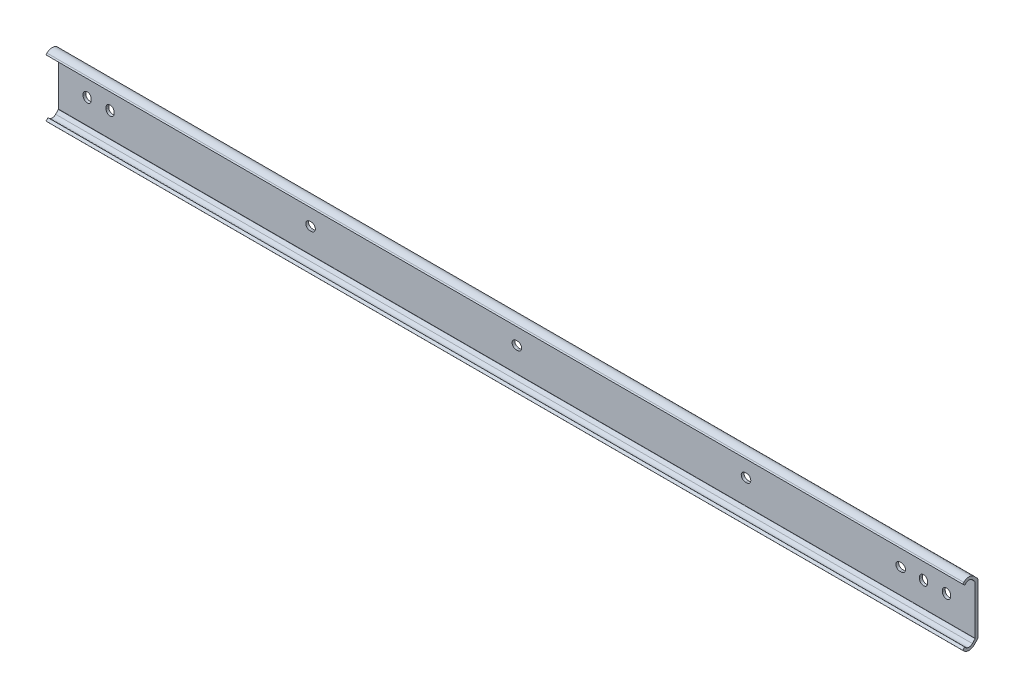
ISO-10303-21;
HEADER;
FILE_DESCRIPTION(('STEP AP214'),'2;1');
FILE_NAME('part.step','',(''),(''),'','','');
FILE_SCHEMA(('AUTOMOTIVE_DESIGN { 1 0 10303 214 1 1 1 1 }'));
ENDSEC;
DATA;
#1=APPLICATION_CONTEXT('core data for automotive mechanical design processes');
#2=APPLICATION_PROTOCOL_DEFINITION('international standard','automotive_design',2000,#1);
#3=PRODUCT_CONTEXT('',#1,'mechanical');
#4=PRODUCT('Part','Part','',(#3));
#5=PRODUCT_RELATED_PRODUCT_CATEGORY('part','',(#4));
#6=PRODUCT_DEFINITION_FORMATION('','',#4);
#7=PRODUCT_DEFINITION_CONTEXT('part definition',#1,'design');
#8=PRODUCT_DEFINITION('design','',#6,#7);
#9=PRODUCT_DEFINITION_SHAPE('','',#8);
#10=(LENGTH_UNIT() NAMED_UNIT(*) SI_UNIT(.MILLI.,.METRE.));
#11=(NAMED_UNIT(*) PLANE_ANGLE_UNIT() SI_UNIT($,.RADIAN.));
#12=(NAMED_UNIT(*) SI_UNIT($,.STERADIAN.) SOLID_ANGLE_UNIT());
#13=UNCERTAINTY_MEASURE_WITH_UNIT(LENGTH_MEASURE(1.E-05),#10,'distance_accuracy_value','');
#14=(GEOMETRIC_REPRESENTATION_CONTEXT(3) GLOBAL_UNCERTAINTY_ASSIGNED_CONTEXT((#13)) GLOBAL_UNIT_ASSIGNED_CONTEXT((#10,
#11,#12)) REPRESENTATION_CONTEXT('',''));
#15=CARTESIAN_POINT('',(0.,0.,0.));
#16=DIRECTION('',(0.,0.,1.));
#17=DIRECTION('',(1.,0.,0.));
#18=AXIS2_PLACEMENT_3D('',#15,#16,#17);
#19=CARTESIAN_POINT('',(-15.9,13.5610179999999,1.54999923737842));
#20=DIRECTION('',(0.,0.,-1.));
#21=DIRECTION('',(1.,0.,0.));
#22=AXIS2_PLACEMENT_3D('',#19,#20,#21);
#23=PLANE('',#22);
#24=DIRECTION('',(1.,0.,0.));
#25=VECTOR('',#24,1.);
#26=CARTESIAN_POINT('',(-15.9,13.5610179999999,1.54999923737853));
#27=LINE('',#26,#25);
#28=CARTESIAN_POINT('',(-15.9,13.5610179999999,1.54999923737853));
#29=VERTEX_POINT('',#28);
#30=CARTESIAN_POINT('',(492.1,13.5610179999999,1.54999923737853));
#31=VERTEX_POINT('',#30);
#32=EDGE_CURVE('E707',#29,#31,#27,.T.);
#33=ORIENTED_EDGE('',*,*,#32,.F.);
#34=DIRECTION('',(0.,1.,0.));
#35=VECTOR('',#34,1.);
#36=CARTESIAN_POINT('',(-15.9,13.5610179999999,1.54999923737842));
#37=LINE('',#36,#35);
#38=CARTESIAN_POINT('',(-15.9,-13.5610179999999,1.54999923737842));
#39=VERTEX_POINT('',#38);
#40=EDGE_CURVE('E655',#39,#29,#37,.T.);
#41=ORIENTED_EDGE('',*,*,#40,.F.);
#42=DIRECTION('',(1.,0.,0.));
#43=VECTOR('',#42,1.);
#44=CARTESIAN_POINT('',(-15.9,-13.5610179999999,1.54999923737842));
#45=LINE('',#44,#43);
#46=CARTESIAN_POINT('',(492.1,-13.5610179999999,1.54999923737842));
#47=VERTEX_POINT('',#46);
#48=EDGE_CURVE('E710',#39,#47,#45,.T.);
#49=ORIENTED_EDGE('',*,*,#48,.T.);
#50=DIRECTION('',(0.,1.,0.));
#51=VECTOR('',#50,1.);
#52=CARTESIAN_POINT('',(492.1,13.5610179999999,1.54999923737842));
#53=LINE('',#52,#51);
#54=EDGE_CURVE('E614',#47,#31,#53,.T.);
#55=ORIENTED_EDGE('',*,*,#54,.T.);
#56=EDGE_LOOP('',(#33,#41,#49,#55));
#57=FACE_BOUND('',#56,.T.);
#58=DIRECTION('',(0.,1.,0.));
#59=VECTOR('',#58,1.);
#60=CARTESIAN_POINT('',(478.45,-0.4,1.54999923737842));
#61=LINE('',#60,#59);
#62=CARTESIAN_POINT('',(478.45,-0.4,1.54999923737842));
#63=VERTEX_POINT('',#62);
#64=CARTESIAN_POINT('',(478.45,0.4,1.54999923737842));
#65=VERTEX_POINT('',#64);
#66=EDGE_CURVE('E362',#63,#65,#61,.T.);
#67=ORIENTED_EDGE('',*,*,#66,.F.);
#68=CARTESIAN_POINT('',(476.2,-0.4,1.54999923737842));
#69=DIRECTION('',(0.,0.,-1.));
#70=DIRECTION('',(1.,0.,0.));
#71=AXIS2_PLACEMENT_3D('',#68,#69,#70);
#72=CIRCLE('',#71,2.24999999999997);
#73=CARTESIAN_POINT('',(473.95,-0.4,1.54999923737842));
#74=VERTEX_POINT('',#73);
#75=EDGE_CURVE('E345',#74,#63,#72,.F.);
#76=ORIENTED_EDGE('',*,*,#75,.F.);
#77=DIRECTION('',(0.,-1.,0.));
#78=VECTOR('',#77,1.);
#79=CARTESIAN_POINT('',(473.95,-0.4,1.54999923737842));
#80=LINE('',#79,#78);
#81=CARTESIAN_POINT('',(473.95,0.4,1.54999923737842));
#82=VERTEX_POINT('',#81);
#83=EDGE_CURVE('E354',#82,#74,#80,.T.);
#84=ORIENTED_EDGE('',*,*,#83,.F.);
#85=CARTESIAN_POINT('',(476.2,0.4,1.54999923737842));
#86=DIRECTION('',(0.,0.,-1.));
#87=DIRECTION('',(1.,0.,0.));
#88=AXIS2_PLACEMENT_3D('',#85,#86,#87);
#89=CIRCLE('',#88,2.24999999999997);
#90=EDGE_CURVE('E29',#65,#82,#89,.F.);
#91=ORIENTED_EDGE('',*,*,#90,.F.);
#92=EDGE_LOOP('',(#67,#76,#84,#91));
#93=FACE_BOUND('',#92,.T.);
#94=DIRECTION('',(0.,1.,0.));
#95=VECTOR('',#94,1.);
#96=CARTESIAN_POINT('',(465.75,-0.4,1.54999923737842));
#97=LINE('',#96,#95);
#98=CARTESIAN_POINT('',(465.75,-0.4,1.54999923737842));
#99=VERTEX_POINT('',#98);
#100=CARTESIAN_POINT('',(465.75,0.4,1.54999923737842));
#101=VERTEX_POINT('',#100);
#102=EDGE_CURVE('E380',#99,#101,#97,.T.);
#103=ORIENTED_EDGE('',*,*,#102,.F.);
#104=CARTESIAN_POINT('',(463.5,-0.4,1.54999923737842));
#105=DIRECTION('',(0.,0.,-1.));
#106=DIRECTION('',(1.,0.,0.));
#107=AXIS2_PLACEMENT_3D('',#104,#105,#106);
#108=CIRCLE('',#107,2.24999999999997);
#109=CARTESIAN_POINT('',(461.25,-0.4,1.54999923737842));
#110=VERTEX_POINT('',#109);
#111=EDGE_CURVE('E383',#110,#99,#108,.F.);
#112=ORIENTED_EDGE('',*,*,#111,.F.);
#113=DIRECTION('',(0.,-1.,0.));
#114=VECTOR('',#113,1.);
#115=CARTESIAN_POINT('',(461.25,-0.4,1.54999923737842));
#116=LINE('',#115,#114);
#117=CARTESIAN_POINT('',(461.25,0.4,1.54999923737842));
#118=VERTEX_POINT('',#117);
#119=EDGE_CURVE('E400',#118,#110,#116,.T.);
#120=ORIENTED_EDGE('',*,*,#119,.F.);
#121=CARTESIAN_POINT('',(463.5,0.4,1.54999923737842));
#122=DIRECTION('',(0.,0.,-1.));
#123=DIRECTION('',(1.,0.,0.));
#124=AXIS2_PLACEMENT_3D('',#121,#122,#123);
#125=CIRCLE('',#124,2.24999999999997);
#126=EDGE_CURVE('E357',#101,#118,#125,.F.);
#127=ORIENTED_EDGE('',*,*,#126,.F.);
#128=EDGE_LOOP('',(#103,#112,#120,#127));
#129=FACE_BOUND('',#128,.T.);
#130=DIRECTION('',(1.,0.,0.));
#131=VECTOR('',#130,1.);
#132=CARTESIAN_POINT('',(450.4,-2.24999999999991,1.54999923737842));
#133=LINE('',#132,#131);
#134=CARTESIAN_POINT('',(450.4,-2.24999999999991,1.54999923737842));
#135=VERTEX_POINT('',#134);
#136=CARTESIAN_POINT('',(451.2,-2.24999999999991,1.54999923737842));
#137=VERTEX_POINT('',#136);
#138=EDGE_CURVE('E411',#135,#137,#133,.T.);
#139=ORIENTED_EDGE('',*,*,#138,.F.);
#140=CARTESIAN_POINT('',(450.4,0.,1.54999923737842));
#141=DIRECTION('',(0.,0.,-1.));
#142=DIRECTION('',(1.,0.,0.));
#143=AXIS2_PLACEMENT_3D('',#140,#141,#142);
#144=CIRCLE('',#143,2.24999999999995);
#145=CARTESIAN_POINT('',(450.4,2.25,1.54999923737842));
#146=VERTEX_POINT('',#145);
#147=EDGE_CURVE('E414',#146,#135,#144,.F.);
#148=ORIENTED_EDGE('',*,*,#147,.F.);
#149=DIRECTION('',(-1.,0.,0.));
#150=VECTOR('',#149,1.);
#151=CARTESIAN_POINT('',(450.4,2.25,1.54999923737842));
#152=LINE('',#151,#150);
#153=CARTESIAN_POINT('',(451.2,2.25,1.54999923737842));
#154=VERTEX_POINT('',#153);
#155=EDGE_CURVE('E431',#154,#146,#152,.T.);
#156=ORIENTED_EDGE('',*,*,#155,.F.);
#157=CARTESIAN_POINT('',(451.2,0.,1.54999923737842));
#158=DIRECTION('',(0.,0.,-1.));
#159=DIRECTION('',(1.,0.,0.));
#160=AXIS2_PLACEMENT_3D('',#157,#158,#159);
#161=CIRCLE('',#160,2.24999999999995);
#162=EDGE_CURVE('E409',#137,#154,#161,.F.);
#163=ORIENTED_EDGE('',*,*,#162,.F.);
#164=EDGE_LOOP('',(#139,#148,#156,#163));
#165=FACE_BOUND('',#164,.T.);
#166=DIRECTION('',(1.,0.,0.));
#167=VECTOR('',#166,1.);
#168=CARTESIAN_POINT('',(364.7,-2.24999999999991,1.54999923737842));
#169=LINE('',#168,#167);
#170=CARTESIAN_POINT('',(364.7,-2.24999999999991,1.54999923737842));
#171=VERTEX_POINT('',#170);
#172=CARTESIAN_POINT('',(365.5,-2.24999999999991,1.54999923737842));
#173=VERTEX_POINT('',#172);
#174=EDGE_CURVE('E442',#171,#173,#169,.T.);
#175=ORIENTED_EDGE('',*,*,#174,.F.);
#176=CARTESIAN_POINT('',(364.7,0.,1.54999923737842));
#177=DIRECTION('',(0.,0.,-1.));
#178=DIRECTION('',(1.,0.,0.));
#179=AXIS2_PLACEMENT_3D('',#176,#177,#178);
#180=CIRCLE('',#179,2.24999999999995);
#181=CARTESIAN_POINT('',(364.7,2.25,1.54999923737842));
#182=VERTEX_POINT('',#181);
#183=EDGE_CURVE('E445',#182,#171,#180,.F.);
#184=ORIENTED_EDGE('',*,*,#183,.F.);
#185=DIRECTION('',(-1.,0.,0.));
#186=VECTOR('',#185,1.);
#187=CARTESIAN_POINT('',(364.7,2.25,1.54999923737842));
#188=LINE('',#187,#186);
#189=CARTESIAN_POINT('',(365.5,2.25,1.54999923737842));
#190=VERTEX_POINT('',#189);
#191=EDGE_CURVE('E462',#190,#182,#188,.T.);
#192=ORIENTED_EDGE('',*,*,#191,.F.);
#193=CARTESIAN_POINT('',(365.5,0.,1.54999923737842));
#194=DIRECTION('',(0.,0.,-1.));
#195=DIRECTION('',(1.,0.,0.));
#196=AXIS2_PLACEMENT_3D('',#193,#194,#195);
#197=CIRCLE('',#196,2.24999999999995);
#198=EDGE_CURVE('E440',#173,#190,#197,.F.);
#199=ORIENTED_EDGE('',*,*,#198,.F.);
#200=EDGE_LOOP('',(#175,#184,#192,#199));
#201=FACE_BOUND('',#200,.T.);
#202=DIRECTION('',(1.,0.,0.));
#203=VECTOR('',#202,1.);
#204=CARTESIAN_POINT('',(237.7,-2.24999999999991,1.54999923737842));
#205=LINE('',#204,#203);
#206=CARTESIAN_POINT('',(237.7,-2.24999999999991,1.54999923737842));
#207=VERTEX_POINT('',#206);
#208=CARTESIAN_POINT('',(238.5,-2.24999999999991,1.54999923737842));
#209=VERTEX_POINT('',#208);
#210=EDGE_CURVE('E473',#207,#209,#205,.T.);
#211=ORIENTED_EDGE('',*,*,#210,.F.);
#212=CARTESIAN_POINT('',(237.7,0.,1.54999923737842));
#213=DIRECTION('',(0.,0.,-1.));
#214=DIRECTION('',(1.,0.,0.));
#215=AXIS2_PLACEMENT_3D('',#212,#213,#214);
#216=CIRCLE('',#215,2.24999999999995);
#217=CARTESIAN_POINT('',(237.7,2.25,1.54999923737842));
#218=VERTEX_POINT('',#217);
#219=EDGE_CURVE('E476',#218,#207,#216,.F.);
#220=ORIENTED_EDGE('',*,*,#219,.F.);
#221=DIRECTION('',(-1.,0.,0.));
#222=VECTOR('',#221,1.);
#223=CARTESIAN_POINT('',(237.7,2.25,1.54999923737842));
#224=LINE('',#223,#222);
#225=CARTESIAN_POINT('',(238.5,2.25,1.54999923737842));
#226=VERTEX_POINT('',#225);
#227=EDGE_CURVE('E493',#226,#218,#224,.T.);
#228=ORIENTED_EDGE('',*,*,#227,.F.);
#229=CARTESIAN_POINT('',(238.5,0.,1.54999923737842));
#230=DIRECTION('',(0.,0.,-1.));
#231=DIRECTION('',(1.,0.,0.));
#232=AXIS2_PLACEMENT_3D('',#229,#230,#231);
#233=CIRCLE('',#232,2.24999999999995);
#234=EDGE_CURVE('E471',#209,#226,#233,.F.);
#235=ORIENTED_EDGE('',*,*,#234,.F.);
#236=EDGE_LOOP('',(#211,#220,#228,#235));
#237=FACE_BOUND('',#236,.T.);
#238=DIRECTION('',(0.,1.,0.));
#239=VECTOR('',#238,1.);
#240=CARTESIAN_POINT('',(14.95,-0.4,1.54999923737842));
#241=LINE('',#240,#239);
#242=CARTESIAN_POINT('',(14.95,-0.4,1.54999923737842));
#243=VERTEX_POINT('',#242);
#244=CARTESIAN_POINT('',(14.95,0.4,1.54999923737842));
#245=VERTEX_POINT('',#244);
#246=EDGE_CURVE('E504',#243,#245,#241,.T.);
#247=ORIENTED_EDGE('',*,*,#246,.F.);
#248=CARTESIAN_POINT('',(12.7,-0.4,1.54999923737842));
#249=DIRECTION('',(0.,0.,-1.));
#250=DIRECTION('',(1.,0.,0.));
#251=AXIS2_PLACEMENT_3D('',#248,#249,#250);
#252=CIRCLE('',#251,2.24999999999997);
#253=CARTESIAN_POINT('',(10.45,-0.4,1.54999923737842));
#254=VERTEX_POINT('',#253);
#255=EDGE_CURVE('E507',#254,#243,#252,.F.);
#256=ORIENTED_EDGE('',*,*,#255,.F.);
#257=DIRECTION('',(0.,-1.,0.));
#258=VECTOR('',#257,1.);
#259=CARTESIAN_POINT('',(10.45,-0.4,1.54999923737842));
#260=LINE('',#259,#258);
#261=CARTESIAN_POINT('',(10.45,0.4,1.54999923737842));
#262=VERTEX_POINT('',#261);
#263=EDGE_CURVE('E524',#262,#254,#260,.T.);
#264=ORIENTED_EDGE('',*,*,#263,.F.);
#265=CARTESIAN_POINT('',(12.7,0.4,1.54999923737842));
#266=DIRECTION('',(0.,0.,-1.));
#267=DIRECTION('',(1.,0.,0.));
#268=AXIS2_PLACEMENT_3D('',#265,#266,#267);
#269=CIRCLE('',#268,2.24999999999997);
#270=EDGE_CURVE('E502',#245,#262,#269,.F.);
#271=ORIENTED_EDGE('',*,*,#270,.F.);
#272=EDGE_LOOP('',(#247,#256,#264,#271));
#273=FACE_BOUND('',#272,.T.);
#274=DIRECTION('',(0.,1.,0.));
#275=VECTOR('',#274,1.);
#276=CARTESIAN_POINT('',(2.24999999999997,-0.4,1.54999923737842));
#277=LINE('',#276,#275);
#278=CARTESIAN_POINT('',(2.24999999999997,-0.4,1.54999923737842));
#279=VERTEX_POINT('',#278);
#280=CARTESIAN_POINT('',(2.24999999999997,0.4,1.54999923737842));
#281=VERTEX_POINT('',#280);
#282=EDGE_CURVE('E535',#279,#281,#277,.T.);
#283=ORIENTED_EDGE('',*,*,#282,.F.);
#284=CARTESIAN_POINT('',(0.,-0.4,1.54999923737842));
#285=DIRECTION('',(0.,0.,-1.));
#286=DIRECTION('',(1.,0.,0.));
#287=AXIS2_PLACEMENT_3D('',#284,#285,#286);
#288=CIRCLE('',#287,2.24999999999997);
#289=CARTESIAN_POINT('',(-2.25000000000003,-0.4,1.54999923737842));
#290=VERTEX_POINT('',#289);
#291=EDGE_CURVE('E538',#290,#279,#288,.F.);
#292=ORIENTED_EDGE('',*,*,#291,.F.);
#293=DIRECTION('',(0.,-1.,0.));
#294=VECTOR('',#293,1.);
#295=CARTESIAN_POINT('',(-2.25000000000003,-0.4,1.54999923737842));
#296=LINE('',#295,#294);
#297=CARTESIAN_POINT('',(-2.25000000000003,0.4,1.54999923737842));
#298=VERTEX_POINT('',#297);
#299=EDGE_CURVE('E555',#298,#290,#296,.T.);
#300=ORIENTED_EDGE('',*,*,#299,.F.);
#301=CARTESIAN_POINT('',(0.,0.4,1.54999923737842));
#302=DIRECTION('',(0.,0.,-1.));
#303=DIRECTION('',(1.,0.,0.));
#304=AXIS2_PLACEMENT_3D('',#301,#302,#303);
#305=CIRCLE('',#304,2.24999999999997);
#306=EDGE_CURVE('E533',#281,#298,#305,.F.);
#307=ORIENTED_EDGE('',*,*,#306,.F.);
#308=EDGE_LOOP('',(#283,#292,#300,#307));
#309=FACE_BOUND('',#308,.T.);
#310=DIRECTION('',(1.,0.,0.));
#311=VECTOR('',#310,1.);
#312=CARTESIAN_POINT('',(123.4,-2.24999999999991,1.54999923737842));
#313=LINE('',#312,#311);
#314=CARTESIAN_POINT('',(123.4,-2.24999999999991,1.54999923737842));
#315=VERTEX_POINT('',#314);
#316=CARTESIAN_POINT('',(124.2,-2.24999999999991,1.54999923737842));
#317=VERTEX_POINT('',#316);
#318=EDGE_CURVE('E566',#315,#317,#313,.T.);
#319=ORIENTED_EDGE('',*,*,#318,.F.);
#320=CARTESIAN_POINT('',(123.4,0.,1.54999923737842));
#321=DIRECTION('',(0.,0.,-1.));
#322=DIRECTION('',(1.,0.,0.));
#323=AXIS2_PLACEMENT_3D('',#320,#321,#322);
#324=CIRCLE('',#323,2.24999999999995);
#325=CARTESIAN_POINT('',(123.4,2.25,1.54999923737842));
#326=VERTEX_POINT('',#325);
#327=EDGE_CURVE('E569',#326,#315,#324,.F.);
#328=ORIENTED_EDGE('',*,*,#327,.F.);
#329=DIRECTION('',(-1.,0.,0.));
#330=VECTOR('',#329,1.);
#331=CARTESIAN_POINT('',(123.4,2.25,1.54999923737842));
#332=LINE('',#331,#330);
#333=CARTESIAN_POINT('',(124.2,2.25,1.54999923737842));
#334=VERTEX_POINT('',#333);
#335=EDGE_CURVE('E586',#334,#326,#332,.T.);
#336=ORIENTED_EDGE('',*,*,#335,.F.);
#337=CARTESIAN_POINT('',(124.2,0.,1.54999923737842));
#338=DIRECTION('',(0.,0.,-1.));
#339=DIRECTION('',(1.,0.,0.));
#340=AXIS2_PLACEMENT_3D('',#337,#338,#339);
#341=CIRCLE('',#340,2.24999999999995);
#342=EDGE_CURVE('E564',#317,#334,#341,.F.);
#343=ORIENTED_EDGE('',*,*,#342,.F.);
#344=EDGE_LOOP('',(#319,#328,#336,#343));
#345=FACE_BOUND('',#344,.T.);
#346=ADVANCED_FACE('F14',(#57,#93,#129,#165,#201,#237,#273,#309,#345),#23,.F.);
#347=CARTESIAN_POINT('',(-15.9,13.5610176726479,0.));
#348=DIRECTION('',(0.,0.,1.));
#349=DIRECTION('',(-1.,0.,0.));
#350=AXIS2_PLACEMENT_3D('',#347,#348,#349);
#351=PLANE('',#350);
#352=DIRECTION('',(0.,1.,0.));
#353=VECTOR('',#352,1.);
#354=CARTESIAN_POINT('',(473.95,-0.4,0.));
#355=LINE('',#354,#353);
#356=CARTESIAN_POINT('',(473.95,-0.4,0.));
#357=VERTEX_POINT('',#356);
#358=CARTESIAN_POINT('',(473.95,0.4,0.));
#359=VERTEX_POINT('',#358);
#360=EDGE_CURVE('E364',#357,#359,#355,.T.);
#361=ORIENTED_EDGE('',*,*,#360,.F.);
#362=CARTESIAN_POINT('',(476.2,-0.4,0.));
#363=DIRECTION('',(0.,0.,-1.));
#364=DIRECTION('',(1.,0.,0.));
#365=AXIS2_PLACEMENT_3D('',#362,#363,#364);
#366=CIRCLE('',#365,2.24999999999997);
#367=CARTESIAN_POINT('',(478.45,-0.4,0.));
#368=VERTEX_POINT('',#367);
#369=EDGE_CURVE('E37',#368,#357,#366,.T.);
#370=ORIENTED_EDGE('',*,*,#369,.F.);
#371=DIRECTION('',(0.,-1.,0.));
#372=VECTOR('',#371,1.);
#373=CARTESIAN_POINT('',(478.45,-0.4,0.));
#374=LINE('',#373,#372);
#375=CARTESIAN_POINT('',(478.45,0.4,0.));
#376=VERTEX_POINT('',#375);
#377=EDGE_CURVE('E351',#376,#368,#374,.T.);
#378=ORIENTED_EDGE('',*,*,#377,.F.);
#379=CARTESIAN_POINT('',(476.2,0.4,0.));
#380=DIRECTION('',(0.,0.,-1.));
#381=DIRECTION('',(1.,0.,0.));
#382=AXIS2_PLACEMENT_3D('',#379,#380,#381);
#383=CIRCLE('',#382,2.24999999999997);
#384=EDGE_CURVE('E370',#359,#376,#383,.T.);
#385=ORIENTED_EDGE('',*,*,#384,.F.);
#386=EDGE_LOOP('',(#361,#370,#378,#385));
#387=FACE_BOUND('',#386,.T.);
#388=DIRECTION('',(0.,1.,0.));
#389=VECTOR('',#388,1.);
#390=CARTESIAN_POINT('',(461.25,-0.4,0.));
#391=LINE('',#390,#389);
#392=CARTESIAN_POINT('',(461.25,-0.4,0.));
#393=VERTEX_POINT('',#392);
#394=CARTESIAN_POINT('',(461.25,0.4,0.));
#395=VERTEX_POINT('',#394);
#396=EDGE_CURVE('E388',#393,#395,#391,.T.);
#397=ORIENTED_EDGE('',*,*,#396,.F.);
#398=CARTESIAN_POINT('',(463.5,-0.4,0.));
#399=DIRECTION('',(0.,0.,-1.));
#400=DIRECTION('',(1.,0.,0.));
#401=AXIS2_PLACEMENT_3D('',#398,#399,#400);
#402=CIRCLE('',#401,2.24999999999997);
#403=CARTESIAN_POINT('',(465.75,-0.4,0.));
#404=VERTEX_POINT('',#403);
#405=EDGE_CURVE('E386',#404,#393,#402,.T.);
#406=ORIENTED_EDGE('',*,*,#405,.F.);
#407=DIRECTION('',(0.,-1.,0.));
#408=VECTOR('',#407,1.);
#409=CARTESIAN_POINT('',(465.75,-0.4,0.));
#410=LINE('',#409,#408);
#411=CARTESIAN_POINT('',(465.75,0.4,0.));
#412=VERTEX_POINT('',#411);
#413=EDGE_CURVE('E394',#412,#404,#410,.T.);
#414=ORIENTED_EDGE('',*,*,#413,.F.);
#415=CARTESIAN_POINT('',(463.5,0.4,0.));
#416=DIRECTION('',(0.,0.,-1.));
#417=DIRECTION('',(1.,0.,0.));
#418=AXIS2_PLACEMENT_3D('',#415,#416,#417);
#419=CIRCLE('',#418,2.24999999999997);
#420=EDGE_CURVE('E391',#395,#412,#419,.T.);
#421=ORIENTED_EDGE('',*,*,#420,.F.);
#422=EDGE_LOOP('',(#397,#406,#414,#421));
#423=FACE_BOUND('',#422,.T.);
#424=DIRECTION('',(1.,0.,0.));
#425=VECTOR('',#424,1.);
#426=CARTESIAN_POINT('',(450.4,2.25,0.));
#427=LINE('',#426,#425);
#428=CARTESIAN_POINT('',(450.4,2.25,0.));
#429=VERTEX_POINT('',#428);
#430=CARTESIAN_POINT('',(451.2,2.25,0.));
#431=VERTEX_POINT('',#430);
#432=EDGE_CURVE('E419',#429,#431,#427,.T.);
#433=ORIENTED_EDGE('',*,*,#432,.F.);
#434=CARTESIAN_POINT('',(450.4,0.,0.));
#435=DIRECTION('',(0.,0.,-1.));
#436=DIRECTION('',(1.,0.,0.));
#437=AXIS2_PLACEMENT_3D('',#434,#435,#436);
#438=CIRCLE('',#437,2.24999999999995);
#439=CARTESIAN_POINT('',(450.4,-2.24999999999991,0.));
#440=VERTEX_POINT('',#439);
#441=EDGE_CURVE('E417',#440,#429,#438,.T.);
#442=ORIENTED_EDGE('',*,*,#441,.F.);
#443=DIRECTION('',(-1.,0.,0.));
#444=VECTOR('',#443,1.);
#445=CARTESIAN_POINT('',(450.4,-2.24999999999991,0.));
#446=LINE('',#445,#444);
#447=CARTESIAN_POINT('',(451.2,-2.24999999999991,0.));
#448=VERTEX_POINT('',#447);
#449=EDGE_CURVE('E425',#448,#440,#446,.T.);
#450=ORIENTED_EDGE('',*,*,#449,.F.);
#451=CARTESIAN_POINT('',(451.2,0.,0.));
#452=DIRECTION('',(0.,0.,-1.));
#453=DIRECTION('',(1.,0.,0.));
#454=AXIS2_PLACEMENT_3D('',#451,#452,#453);
#455=CIRCLE('',#454,2.24999999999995);
#456=EDGE_CURVE('E422',#431,#448,#455,.T.);
#457=ORIENTED_EDGE('',*,*,#456,.F.);
#458=EDGE_LOOP('',(#433,#442,#450,#457));
#459=FACE_BOUND('',#458,.T.);
#460=DIRECTION('',(1.,0.,0.));
#461=VECTOR('',#460,1.);
#462=CARTESIAN_POINT('',(364.7,2.25,0.));
#463=LINE('',#462,#461);
#464=CARTESIAN_POINT('',(364.7,2.25,0.));
#465=VERTEX_POINT('',#464);
#466=CARTESIAN_POINT('',(365.5,2.25,0.));
#467=VERTEX_POINT('',#466);
#468=EDGE_CURVE('E450',#465,#467,#463,.T.);
#469=ORIENTED_EDGE('',*,*,#468,.F.);
#470=CARTESIAN_POINT('',(364.7,0.,0.));
#471=DIRECTION('',(0.,0.,-1.));
#472=DIRECTION('',(1.,0.,0.));
#473=AXIS2_PLACEMENT_3D('',#470,#471,#472);
#474=CIRCLE('',#473,2.24999999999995);
#475=CARTESIAN_POINT('',(364.7,-2.24999999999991,0.));
#476=VERTEX_POINT('',#475);
#477=EDGE_CURVE('E448',#476,#465,#474,.T.);
#478=ORIENTED_EDGE('',*,*,#477,.F.);
#479=DIRECTION('',(-1.,0.,0.));
#480=VECTOR('',#479,1.);
#481=CARTESIAN_POINT('',(364.7,-2.24999999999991,0.));
#482=LINE('',#481,#480);
#483=CARTESIAN_POINT('',(365.5,-2.24999999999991,0.));
#484=VERTEX_POINT('',#483);
#485=EDGE_CURVE('E456',#484,#476,#482,.T.);
#486=ORIENTED_EDGE('',*,*,#485,.F.);
#487=CARTESIAN_POINT('',(365.5,0.,0.));
#488=DIRECTION('',(0.,0.,-1.));
#489=DIRECTION('',(1.,0.,0.));
#490=AXIS2_PLACEMENT_3D('',#487,#488,#489);
#491=CIRCLE('',#490,2.24999999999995);
#492=EDGE_CURVE('E453',#467,#484,#491,.T.);
#493=ORIENTED_EDGE('',*,*,#492,.F.);
#494=EDGE_LOOP('',(#469,#478,#486,#493));
#495=FACE_BOUND('',#494,.T.);
#496=DIRECTION('',(1.,0.,0.));
#497=VECTOR('',#496,1.);
#498=CARTESIAN_POINT('',(237.7,2.25,0.));
#499=LINE('',#498,#497);
#500=CARTESIAN_POINT('',(237.7,2.25,0.));
#501=VERTEX_POINT('',#500);
#502=CARTESIAN_POINT('',(238.5,2.25,0.));
#503=VERTEX_POINT('',#502);
#504=EDGE_CURVE('E481',#501,#503,#499,.T.);
#505=ORIENTED_EDGE('',*,*,#504,.F.);
#506=CARTESIAN_POINT('',(237.7,0.,0.));
#507=DIRECTION('',(0.,0.,-1.));
#508=DIRECTION('',(1.,0.,0.));
#509=AXIS2_PLACEMENT_3D('',#506,#507,#508);
#510=CIRCLE('',#509,2.24999999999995);
#511=CARTESIAN_POINT('',(237.7,-2.24999999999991,0.));
#512=VERTEX_POINT('',#511);
#513=EDGE_CURVE('E479',#512,#501,#510,.T.);
#514=ORIENTED_EDGE('',*,*,#513,.F.);
#515=DIRECTION('',(-1.,0.,0.));
#516=VECTOR('',#515,1.);
#517=CARTESIAN_POINT('',(237.7,-2.24999999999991,0.));
#518=LINE('',#517,#516);
#519=CARTESIAN_POINT('',(238.5,-2.24999999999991,0.));
#520=VERTEX_POINT('',#519);
#521=EDGE_CURVE('E487',#520,#512,#518,.T.);
#522=ORIENTED_EDGE('',*,*,#521,.F.);
#523=CARTESIAN_POINT('',(238.5,0.,0.));
#524=DIRECTION('',(0.,0.,-1.));
#525=DIRECTION('',(1.,0.,0.));
#526=AXIS2_PLACEMENT_3D('',#523,#524,#525);
#527=CIRCLE('',#526,2.24999999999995);
#528=EDGE_CURVE('E484',#503,#520,#527,.T.);
#529=ORIENTED_EDGE('',*,*,#528,.F.);
#530=EDGE_LOOP('',(#505,#514,#522,#529));
#531=FACE_BOUND('',#530,.T.);
#532=DIRECTION('',(0.,1.,0.));
#533=VECTOR('',#532,1.);
#534=CARTESIAN_POINT('',(10.45,-0.4,0.));
#535=LINE('',#534,#533);
#536=CARTESIAN_POINT('',(10.45,-0.4,0.));
#537=VERTEX_POINT('',#536);
#538=CARTESIAN_POINT('',(10.45,0.4,0.));
#539=VERTEX_POINT('',#538);
#540=EDGE_CURVE('E512',#537,#539,#535,.T.);
#541=ORIENTED_EDGE('',*,*,#540,.F.);
#542=CARTESIAN_POINT('',(12.7,-0.4,0.));
#543=DIRECTION('',(0.,0.,-1.));
#544=DIRECTION('',(1.,0.,0.));
#545=AXIS2_PLACEMENT_3D('',#542,#543,#544);
#546=CIRCLE('',#545,2.24999999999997);
#547=CARTESIAN_POINT('',(14.95,-0.4,0.));
#548=VERTEX_POINT('',#547);
#549=EDGE_CURVE('E510',#548,#537,#546,.T.);
#550=ORIENTED_EDGE('',*,*,#549,.F.);
#551=DIRECTION('',(0.,-1.,0.));
#552=VECTOR('',#551,1.);
#553=CARTESIAN_POINT('',(14.95,-0.4,0.));
#554=LINE('',#553,#552);
#555=CARTESIAN_POINT('',(14.95,0.4,0.));
#556=VERTEX_POINT('',#555);
#557=EDGE_CURVE('E518',#556,#548,#554,.T.);
#558=ORIENTED_EDGE('',*,*,#557,.F.);
#559=CARTESIAN_POINT('',(12.7,0.4,0.));
#560=DIRECTION('',(0.,0.,-1.));
#561=DIRECTION('',(1.,0.,0.));
#562=AXIS2_PLACEMENT_3D('',#559,#560,#561);
#563=CIRCLE('',#562,2.24999999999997);
#564=EDGE_CURVE('E515',#539,#556,#563,.T.);
#565=ORIENTED_EDGE('',*,*,#564,.F.);
#566=EDGE_LOOP('',(#541,#550,#558,#565));
#567=FACE_BOUND('',#566,.T.);
#568=DIRECTION('',(0.,1.,0.));
#569=VECTOR('',#568,1.);
#570=CARTESIAN_POINT('',(-2.25000000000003,-0.4,0.));
#571=LINE('',#570,#569);
#572=CARTESIAN_POINT('',(-2.25000000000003,-0.4,0.));
#573=VERTEX_POINT('',#572);
#574=CARTESIAN_POINT('',(-2.25000000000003,0.4,0.));
#575=VERTEX_POINT('',#574);
#576=EDGE_CURVE('E543',#573,#575,#571,.T.);
#577=ORIENTED_EDGE('',*,*,#576,.F.);
#578=CARTESIAN_POINT('',(0.,-0.4,0.));
#579=DIRECTION('',(0.,0.,-1.));
#580=DIRECTION('',(1.,0.,0.));
#581=AXIS2_PLACEMENT_3D('',#578,#579,#580);
#582=CIRCLE('',#581,2.24999999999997);
#583=CARTESIAN_POINT('',(2.24999999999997,-0.4,0.));
#584=VERTEX_POINT('',#583);
#585=EDGE_CURVE('E541',#584,#573,#582,.T.);
#586=ORIENTED_EDGE('',*,*,#585,.F.);
#587=DIRECTION('',(0.,-1.,0.));
#588=VECTOR('',#587,1.);
#589=CARTESIAN_POINT('',(2.24999999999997,-0.4,0.));
#590=LINE('',#589,#588);
#591=CARTESIAN_POINT('',(2.24999999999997,0.4,0.));
#592=VERTEX_POINT('',#591);
#593=EDGE_CURVE('E549',#592,#584,#590,.T.);
#594=ORIENTED_EDGE('',*,*,#593,.F.);
#595=CARTESIAN_POINT('',(0.,0.4,0.));
#596=DIRECTION('',(0.,0.,-1.));
#597=DIRECTION('',(1.,0.,0.));
#598=AXIS2_PLACEMENT_3D('',#595,#596,#597);
#599=CIRCLE('',#598,2.24999999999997);
#600=EDGE_CURVE('E546',#575,#592,#599,.T.);
#601=ORIENTED_EDGE('',*,*,#600,.F.);
#602=EDGE_LOOP('',(#577,#586,#594,#601));
#603=FACE_BOUND('',#602,.T.);
#604=DIRECTION('',(1.,0.,0.));
#605=VECTOR('',#604,1.);
#606=CARTESIAN_POINT('',(123.4,2.25,0.));
#607=LINE('',#606,#605);
#608=CARTESIAN_POINT('',(123.4,2.25,0.));
#609=VERTEX_POINT('',#608);
#610=CARTESIAN_POINT('',(124.2,2.25,0.));
#611=VERTEX_POINT('',#610);
#612=EDGE_CURVE('E574',#609,#611,#607,.T.);
#613=ORIENTED_EDGE('',*,*,#612,.F.);
#614=CARTESIAN_POINT('',(123.4,0.,0.));
#615=DIRECTION('',(0.,0.,-1.));
#616=DIRECTION('',(1.,0.,0.));
#617=AXIS2_PLACEMENT_3D('',#614,#615,#616);
#618=CIRCLE('',#617,2.24999999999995);
#619=CARTESIAN_POINT('',(123.4,-2.24999999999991,0.));
#620=VERTEX_POINT('',#619);
#621=EDGE_CURVE('E572',#620,#609,#618,.T.);
#622=ORIENTED_EDGE('',*,*,#621,.F.);
#623=DIRECTION('',(-1.,0.,0.));
#624=VECTOR('',#623,1.);
#625=CARTESIAN_POINT('',(123.4,-2.24999999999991,0.));
#626=LINE('',#625,#624);
#627=CARTESIAN_POINT('',(124.2,-2.24999999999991,0.));
#628=VERTEX_POINT('',#627);
#629=EDGE_CURVE('E580',#628,#620,#626,.T.);
#630=ORIENTED_EDGE('',*,*,#629,.F.);
#631=CARTESIAN_POINT('',(124.2,0.,0.));
#632=DIRECTION('',(0.,0.,-1.));
#633=DIRECTION('',(1.,0.,0.));
#634=AXIS2_PLACEMENT_3D('',#631,#632,#633);
#635=CIRCLE('',#634,2.24999999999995);
#636=EDGE_CURVE('E577',#611,#628,#635,.T.);
#637=ORIENTED_EDGE('',*,*,#636,.F.);
#638=EDGE_LOOP('',(#613,#622,#630,#637));
#639=FACE_BOUND('',#638,.T.);
#640=DIRECTION('',(1.,0.,0.));
#641=VECTOR('',#640,1.);
#642=CARTESIAN_POINT('',(-15.9,-13.5610176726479,0.));
#643=LINE('',#642,#641);
#644=CARTESIAN_POINT('',(-15.9,-13.5610176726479,0.));
#645=VERTEX_POINT('',#644);
#646=CARTESIAN_POINT('',(492.1,-13.5610176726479,0.));
#647=VERTEX_POINT('',#646);
#648=EDGE_CURVE('E677',#645,#647,#643,.T.);
#649=ORIENTED_EDGE('',*,*,#648,.F.);
#650=DIRECTION('',(0.,-1.,0.));
#651=VECTOR('',#650,1.);
#652=CARTESIAN_POINT('',(-15.9,13.5610176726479,0.));
#653=LINE('',#652,#651);
#654=CARTESIAN_POINT('',(-15.9,13.5610176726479,0.));
#655=VERTEX_POINT('',#654);
#656=EDGE_CURVE('E675',#655,#645,#653,.T.);
#657=ORIENTED_EDGE('',*,*,#656,.F.);
#658=DIRECTION('',(1.,0.,0.));
#659=VECTOR('',#658,1.);
#660=CARTESIAN_POINT('',(-15.9,13.5610176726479,0.));
#661=LINE('',#660,#659);
#662=CARTESIAN_POINT('',(492.1,13.5610176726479,0.));
#663=VERTEX_POINT('',#662);
#664=EDGE_CURVE('E680',#655,#663,#661,.T.);
#665=ORIENTED_EDGE('',*,*,#664,.T.);
#666=DIRECTION('',(0.,-1.,0.));
#667=VECTOR('',#666,1.);
#668=CARTESIAN_POINT('',(492.1,13.5610176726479,0.));
#669=LINE('',#668,#667);
#670=EDGE_CURVE('E634',#663,#647,#669,.T.);
#671=ORIENTED_EDGE('',*,*,#670,.T.);
#672=EDGE_LOOP('',(#649,#657,#665,#671));
#673=FACE_BOUND('',#672,.T.);
#674=ADVANCED_FACE('F765',(#387,#423,#459,#495,#531,#567,#603,#639,#673),#351,.F.);
#675=CARTESIAN_POINT('',(-15.9,-13.5610175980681,1.80000204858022));
#676=DIRECTION('',(1.,0.,0.));
#677=DIRECTION('',(0.,0.,1.));
#678=AXIS2_PLACEMENT_3D('',#675,#676,#677);
#679=PLANE('',#678);
#680=ORIENTED_EDGE('',*,*,#40,.T.);
#681=CARTESIAN_POINT('',(-15.9,13.5610175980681,1.80000204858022));
#682=DIRECTION('',(1.,0.,0.));
#683=DIRECTION('',(0.,0.,1.));
#684=AXIS2_PLACEMENT_3D('',#681,#682,#683);
#685=CIRCLE('',#684,0.250002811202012);
#686=CARTESIAN_POINT('',(-15.9,13.7341215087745,1.61962344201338));
#687=VERTEX_POINT('',#686);
#688=EDGE_CURVE('E657',#29,#687,#685,.T.);
#689=ORIENTED_EDGE('',*,*,#688,.T.);
#690=DIRECTION('',(0.,0.72150413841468,0.692410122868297));
#691=VECTOR('',#690,1.);
#692=CARTESIAN_POINT('',(-15.9,13.7341215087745,1.61962344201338));
#693=LINE('',#692,#691);
#694=CARTESIAN_POINT('',(-15.9,15.2920521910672,3.11473194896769));
#695=VERTEX_POINT('',#694);
#696=EDGE_CURVE('E659',#687,#695,#693,.T.);
#697=ORIENTED_EDGE('',*,*,#696,.T.);
#698=CARTESIAN_POINT('',(-15.9,13.5750002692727,4.99999970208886));
#699=DIRECTION('',(1.,0.,0.));
#700=DIRECTION('',(0.,0.,1.));
#701=AXIS2_PLACEMENT_3D('',#698,#699,#700);
#702=CIRCLE('',#701,2.55000035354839);
#703=CARTESIAN_POINT('',(-15.9,15.2920597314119,6.88526058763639));
#704=VERTEX_POINT('',#703);
#705=EDGE_CURVE('E661',#695,#704,#702,.T.);
#706=ORIENTED_EDGE('',*,*,#705,.T.);
#707=DIRECTION('',(0.,-0.721504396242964,0.692409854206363));
#708=VECTOR('',#707,1.);
#709=CARTESIAN_POINT('',(-15.9,15.2920597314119,6.88526058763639));
#710=LINE('',#709,#708);
#711=CARTESIAN_POINT('',(-15.9,14.7934625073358,7.36375196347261));
#712=VERTEX_POINT('',#711);
#713=EDGE_CURVE('E663',#704,#712,#710,.T.);
#714=ORIENTED_EDGE('',*,*,#713,.T.);
#715=DIRECTION('',(0.,0.707106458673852,0.707107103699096));
#716=VECTOR('',#715,1.);
#717=CARTESIAN_POINT('',(-15.9,14.7934625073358,7.36375196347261));
#718=LINE('',#717,#716);
#719=CARTESIAN_POINT('',(-15.9,15.8897095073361,8.45999996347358));
#720=VERTEX_POINT('',#719);
#721=EDGE_CURVE('E665',#712,#720,#718,.T.);
#722=ORIENTED_EDGE('',*,*,#721,.T.);
#723=DIRECTION('',(0.,0.721503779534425,-0.692410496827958));
#724=VECTOR('',#723,1.);
#725=CARTESIAN_POINT('',(-15.9,16.4741385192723,7.89913695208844));
#726=LINE('',#725,#724);
#727=CARTESIAN_POINT('',(-15.9,16.4741385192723,7.89913695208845));
#728=VERTEX_POINT('',#727);
#729=EDGE_CURVE('E667',#720,#728,#726,.T.);
#730=ORIENTED_EDGE('',*,*,#729,.T.);
#731=CARTESIAN_POINT('',(-15.9,13.5750002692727,4.99999970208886));
#732=DIRECTION('',(-1.,0.,0.));
#733=DIRECTION('',(0.,0.,-1.));
#734=AXIS2_PLACEMENT_3D('',#731,#732,#733);
#735=CIRCLE('',#734,4.09999992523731);
#736=CARTESIAN_POINT('',(-15.9,16.4741380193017,2.10086195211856));
#737=VERTEX_POINT('',#736);
#738=EDGE_CURVE('E669',#728,#737,#735,.T.);
#739=ORIENTED_EDGE('',*,*,#738,.T.);
#740=DIRECTION('',(0.,-0.721504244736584,-0.692410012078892));
#741=VECTOR('',#740,1.);
#742=CARTESIAN_POINT('',(-15.9,14.8073560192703,0.501291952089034));
#743=LINE('',#742,#741);
#744=CARTESIAN_POINT('',(-15.9,14.8073560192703,0.501291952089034));
#745=VERTEX_POINT('',#744);
#746=EDGE_CURVE('E671',#737,#745,#743,.T.);
#747=ORIENTED_EDGE('',*,*,#746,.T.);
#748=CARTESIAN_POINT('',(-15.9,13.5610175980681,1.80000204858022));
#749=DIRECTION('',(-1.,0.,0.));
#750=DIRECTION('',(0.,0.,-1.));
#751=AXIS2_PLACEMENT_3D('',#748,#749,#750);
#752=CIRCLE('',#751,1.80000204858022);
#753=EDGE_CURVE('E673',#745,#655,#752,.T.);
#754=ORIENTED_EDGE('',*,*,#753,.T.);
#755=ORIENTED_EDGE('',*,*,#656,.T.);
#756=CARTESIAN_POINT('',(-15.9,-13.5610175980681,1.80000204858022));
#757=DIRECTION('',(-1.,0.,0.));
#758=DIRECTION('',(0.,0.,1.));
#759=AXIS2_PLACEMENT_3D('',#756,#757,#758);
#760=CIRCLE('',#759,1.80000204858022);
#761=CARTESIAN_POINT('',(-15.9,-14.8073560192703,0.501291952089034));
#762=VERTEX_POINT('',#761);
#763=EDGE_CURVE('E636',#645,#762,#760,.T.);
#764=ORIENTED_EDGE('',*,*,#763,.T.);
#765=DIRECTION('',(0.,-0.721504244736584,0.692410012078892));
#766=VECTOR('',#765,1.);
#767=CARTESIAN_POINT('',(-15.9,-14.8073560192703,0.501291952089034));
#768=LINE('',#767,#766);
#769=CARTESIAN_POINT('',(-15.9,-16.4741380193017,2.10086195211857));
#770=VERTEX_POINT('',#769);
#771=EDGE_CURVE('E639',#762,#770,#768,.T.);
#772=ORIENTED_EDGE('',*,*,#771,.T.);
#773=CARTESIAN_POINT('',(-15.9,-13.5750002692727,4.99999970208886));
#774=DIRECTION('',(-1.,0.,0.));
#775=DIRECTION('',(0.,0.,1.));
#776=AXIS2_PLACEMENT_3D('',#773,#774,#775);
#777=CIRCLE('',#776,4.09999992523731);
#778=CARTESIAN_POINT('',(-15.9,-16.4741385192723,7.89913695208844));
#779=VERTEX_POINT('',#778);
#780=EDGE_CURVE('E641',#770,#779,#777,.T.);
#781=ORIENTED_EDGE('',*,*,#780,.T.);
#782=DIRECTION('',(0.,0.721503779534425,0.692410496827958));
#783=VECTOR('',#782,1.);
#784=CARTESIAN_POINT('',(-15.9,-16.4741385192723,7.89913695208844));
#785=LINE('',#784,#783);
#786=CARTESIAN_POINT('',(-15.9,-15.8897095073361,8.45999996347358));
#787=VERTEX_POINT('',#786);
#788=EDGE_CURVE('E643',#779,#787,#785,.T.);
#789=ORIENTED_EDGE('',*,*,#788,.T.);
#790=DIRECTION('',(0.,0.707106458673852,-0.707107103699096));
#791=VECTOR('',#790,1.);
#792=CARTESIAN_POINT('',(-15.9,-14.7934625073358,7.36375196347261));
#793=LINE('',#792,#791);
#794=CARTESIAN_POINT('',(-15.9,-14.7934625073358,7.36375196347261));
#795=VERTEX_POINT('',#794);
#796=EDGE_CURVE('E645',#787,#795,#793,.T.);
#797=ORIENTED_EDGE('',*,*,#796,.T.);
#798=DIRECTION('',(0.,-0.721504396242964,-0.692409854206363));
#799=VECTOR('',#798,1.);
#800=CARTESIAN_POINT('',(-15.9,-15.2920597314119,6.88526058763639));
#801=LINE('',#800,#799);
#802=CARTESIAN_POINT('',(-15.9,-15.2920597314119,6.88526058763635));
#803=VERTEX_POINT('',#802);
#804=EDGE_CURVE('E647',#795,#803,#801,.T.);
#805=ORIENTED_EDGE('',*,*,#804,.T.);
#806=CARTESIAN_POINT('',(-15.9,-13.5750002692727,4.99999970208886));
#807=DIRECTION('',(1.,0.,0.));
#808=DIRECTION('',(0.,0.,-1.));
#809=AXIS2_PLACEMENT_3D('',#806,#807,#808);
#810=CIRCLE('',#809,2.55000035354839);
#811=CARTESIAN_POINT('',(-15.9,-15.2920521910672,3.11473194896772));
#812=VERTEX_POINT('',#811);
#813=EDGE_CURVE('E649',#803,#812,#810,.T.);
#814=ORIENTED_EDGE('',*,*,#813,.T.);
#815=DIRECTION('',(0.,0.72150413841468,-0.692410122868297));
#816=VECTOR('',#815,1.);
#817=CARTESIAN_POINT('',(-15.9,-13.7341215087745,1.61962344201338));
#818=LINE('',#817,#816);
#819=CARTESIAN_POINT('',(-15.9,-13.7341215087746,1.6196234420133));
#820=VERTEX_POINT('',#819);
#821=EDGE_CURVE('E651',#812,#820,#818,.T.);
#822=ORIENTED_EDGE('',*,*,#821,.T.);
#823=CARTESIAN_POINT('',(-15.9,-13.5610175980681,1.80000204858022));
#824=DIRECTION('',(1.,0.,0.));
#825=DIRECTION('',(0.,0.,-1.));
#826=AXIS2_PLACEMENT_3D('',#823,#824,#825);
#827=CIRCLE('',#826,0.250002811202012);
#828=EDGE_CURVE('E653',#820,#39,#827,.T.);
#829=ORIENTED_EDGE('',*,*,#828,.T.);
#830=EDGE_LOOP('',(#680,#689,#697,#706,#714,#722,#730,#739,#747,#754,#755,#764,#772,#781,#789,
#797,#805,#814,#822,#829));
#831=FACE_BOUND('',#830,.T.);
#832=ADVANCED_FACE('F754',(#831),#679,.F.);
#833=CARTESIAN_POINT('',(492.1,-13.5610175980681,1.80000204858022));
#834=DIRECTION('',(1.,0.,0.));
#835=DIRECTION('',(0.,0.,1.));
#836=AXIS2_PLACEMENT_3D('',#833,#834,#835);
#837=PLANE('',#836);
#838=CARTESIAN_POINT('',(492.1,-13.5610175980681,1.80000204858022));
#839=DIRECTION('',(-1.,0.,0.));
#840=DIRECTION('',(0.,0.,1.));
#841=AXIS2_PLACEMENT_3D('',#838,#839,#840);
#842=CIRCLE('',#841,1.80000204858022);
#843=CARTESIAN_POINT('',(492.1,-14.8073560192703,0.501291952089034));
#844=VERTEX_POINT('',#843);
#845=EDGE_CURVE('E595',#647,#844,#842,.T.);
#846=ORIENTED_EDGE('',*,*,#845,.F.);
#847=ORIENTED_EDGE('',*,*,#670,.F.);
#848=CARTESIAN_POINT('',(492.1,13.5610175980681,1.80000204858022));
#849=DIRECTION('',(-1.,0.,0.));
#850=DIRECTION('',(0.,0.,-1.));
#851=AXIS2_PLACEMENT_3D('',#848,#849,#850);
#852=CIRCLE('',#851,1.80000204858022);
#853=CARTESIAN_POINT('',(492.1,14.8073560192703,0.501291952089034));
#854=VERTEX_POINT('',#853);
#855=EDGE_CURVE('E632',#854,#663,#852,.T.);
#856=ORIENTED_EDGE('',*,*,#855,.F.);
#857=DIRECTION('',(0.,-0.721504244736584,-0.692410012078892));
#858=VECTOR('',#857,1.);
#859=CARTESIAN_POINT('',(492.1,14.8073560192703,0.501291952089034));
#860=LINE('',#859,#858);
#861=CARTESIAN_POINT('',(492.1,16.4741380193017,2.10086195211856));
#862=VERTEX_POINT('',#861);
#863=EDGE_CURVE('E630',#862,#854,#860,.T.);
#864=ORIENTED_EDGE('',*,*,#863,.F.);
#865=CARTESIAN_POINT('',(492.1,13.5750002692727,4.99999970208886));
#866=DIRECTION('',(-1.,0.,0.));
#867=DIRECTION('',(0.,0.,-1.));
#868=AXIS2_PLACEMENT_3D('',#865,#866,#867);
#869=CIRCLE('',#868,4.09999992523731);
#870=CARTESIAN_POINT('',(492.1,16.4741385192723,7.89913695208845));
#871=VERTEX_POINT('',#870);
#872=EDGE_CURVE('E628',#871,#862,#869,.T.);
#873=ORIENTED_EDGE('',*,*,#872,.F.);
#874=DIRECTION('',(0.,0.721503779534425,-0.692410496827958));
#875=VECTOR('',#874,1.);
#876=CARTESIAN_POINT('',(492.1,16.4741385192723,7.89913695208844));
#877=LINE('',#876,#875);
#878=CARTESIAN_POINT('',(492.1,15.8897095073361,8.45999996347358));
#879=VERTEX_POINT('',#878);
#880=EDGE_CURVE('E626',#879,#871,#877,.T.);
#881=ORIENTED_EDGE('',*,*,#880,.F.);
#882=DIRECTION('',(0.,0.707106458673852,0.707107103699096));
#883=VECTOR('',#882,1.);
#884=CARTESIAN_POINT('',(492.1,14.7934625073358,7.36375196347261));
#885=LINE('',#884,#883);
#886=CARTESIAN_POINT('',(492.1,14.7934625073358,7.36375196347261));
#887=VERTEX_POINT('',#886);
#888=EDGE_CURVE('E624',#887,#879,#885,.T.);
#889=ORIENTED_EDGE('',*,*,#888,.F.);
#890=DIRECTION('',(0.,-0.721504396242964,0.692409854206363));
#891=VECTOR('',#890,1.);
#892=CARTESIAN_POINT('',(492.1,15.2920597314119,6.88526058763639));
#893=LINE('',#892,#891);
#894=CARTESIAN_POINT('',(492.1,15.2920597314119,6.88526058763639));
#895=VERTEX_POINT('',#894);
#896=EDGE_CURVE('E622',#895,#887,#893,.T.);
#897=ORIENTED_EDGE('',*,*,#896,.F.);
#898=CARTESIAN_POINT('',(492.1,13.5750002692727,4.99999970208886));
#899=DIRECTION('',(1.,0.,0.));
#900=DIRECTION('',(0.,0.,1.));
#901=AXIS2_PLACEMENT_3D('',#898,#899,#900);
#902=CIRCLE('',#901,2.55000035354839);
#903=CARTESIAN_POINT('',(492.1,15.2920521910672,3.11473194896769));
#904=VERTEX_POINT('',#903);
#905=EDGE_CURVE('E620',#904,#895,#902,.T.);
#906=ORIENTED_EDGE('',*,*,#905,.F.);
#907=DIRECTION('',(0.,0.72150413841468,0.692410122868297));
#908=VECTOR('',#907,1.);
#909=CARTESIAN_POINT('',(492.1,13.7341215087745,1.61962344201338));
#910=LINE('',#909,#908);
#911=CARTESIAN_POINT('',(492.1,13.7341215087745,1.61962344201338));
#912=VERTEX_POINT('',#911);
#913=EDGE_CURVE('E618',#912,#904,#910,.T.);
#914=ORIENTED_EDGE('',*,*,#913,.F.);
#915=CARTESIAN_POINT('',(492.1,13.5610175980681,1.80000204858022));
#916=DIRECTION('',(1.,0.,0.));
#917=DIRECTION('',(0.,0.,1.));
#918=AXIS2_PLACEMENT_3D('',#915,#916,#917);
#919=CIRCLE('',#918,0.250002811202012);
#920=EDGE_CURVE('E616',#31,#912,#919,.T.);
#921=ORIENTED_EDGE('',*,*,#920,.F.);
#922=ORIENTED_EDGE('',*,*,#54,.F.);
#923=CARTESIAN_POINT('',(492.1,-13.5610175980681,1.80000204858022));
#924=DIRECTION('',(1.,0.,0.));
#925=DIRECTION('',(0.,0.,-1.));
#926=AXIS2_PLACEMENT_3D('',#923,#924,#925);
#927=CIRCLE('',#926,0.250002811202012);
#928=CARTESIAN_POINT('',(492.1,-13.7341215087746,1.6196234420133));
#929=VERTEX_POINT('',#928);
#930=EDGE_CURVE('E612',#929,#47,#927,.T.);
#931=ORIENTED_EDGE('',*,*,#930,.F.);
#932=DIRECTION('',(0.,0.72150413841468,-0.692410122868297));
#933=VECTOR('',#932,1.);
#934=CARTESIAN_POINT('',(492.1,-13.7341215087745,1.61962344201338));
#935=LINE('',#934,#933);
#936=CARTESIAN_POINT('',(492.1,-15.2920521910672,3.11473194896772));
#937=VERTEX_POINT('',#936);
#938=EDGE_CURVE('E610',#937,#929,#935,.T.);
#939=ORIENTED_EDGE('',*,*,#938,.F.);
#940=CARTESIAN_POINT('',(492.1,-13.5750002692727,4.99999970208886));
#941=DIRECTION('',(1.,0.,0.));
#942=DIRECTION('',(0.,0.,-1.));
#943=AXIS2_PLACEMENT_3D('',#940,#941,#942);
#944=CIRCLE('',#943,2.55000035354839);
#945=CARTESIAN_POINT('',(492.1,-15.2920597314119,6.88526058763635));
#946=VERTEX_POINT('',#945);
#947=EDGE_CURVE('E608',#946,#937,#944,.T.);
#948=ORIENTED_EDGE('',*,*,#947,.F.);
#949=DIRECTION('',(0.,-0.721504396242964,-0.692409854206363));
#950=VECTOR('',#949,1.);
#951=CARTESIAN_POINT('',(492.1,-15.2920597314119,6.88526058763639));
#952=LINE('',#951,#950);
#953=CARTESIAN_POINT('',(492.1,-14.7934625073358,7.36375196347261));
#954=VERTEX_POINT('',#953);
#955=EDGE_CURVE('E606',#954,#946,#952,.T.);
#956=ORIENTED_EDGE('',*,*,#955,.F.);
#957=DIRECTION('',(0.,0.707106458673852,-0.707107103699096));
#958=VECTOR('',#957,1.);
#959=CARTESIAN_POINT('',(492.1,-14.7934625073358,7.36375196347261));
#960=LINE('',#959,#958);
#961=CARTESIAN_POINT('',(492.1,-15.8897095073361,8.45999996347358));
#962=VERTEX_POINT('',#961);
#963=EDGE_CURVE('E604',#962,#954,#960,.T.);
#964=ORIENTED_EDGE('',*,*,#963,.F.);
#965=DIRECTION('',(0.,0.721503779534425,0.692410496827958));
#966=VECTOR('',#965,1.);
#967=CARTESIAN_POINT('',(492.1,-16.4741385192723,7.89913695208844));
#968=LINE('',#967,#966);
#969=CARTESIAN_POINT('',(492.1,-16.4741385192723,7.89913695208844));
#970=VERTEX_POINT('',#969);
#971=EDGE_CURVE('E602',#970,#962,#968,.T.);
#972=ORIENTED_EDGE('',*,*,#971,.F.);
#973=CARTESIAN_POINT('',(492.1,-13.5750002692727,4.99999970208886));
#974=DIRECTION('',(-1.,0.,0.));
#975=DIRECTION('',(0.,0.,1.));
#976=AXIS2_PLACEMENT_3D('',#973,#974,#975);
#977=CIRCLE('',#976,4.09999992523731);
#978=CARTESIAN_POINT('',(492.1,-16.4741380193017,2.10086195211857));
#979=VERTEX_POINT('',#978);
#980=EDGE_CURVE('E600',#979,#970,#977,.T.);
#981=ORIENTED_EDGE('',*,*,#980,.F.);
#982=DIRECTION('',(0.,-0.721504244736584,0.692410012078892));
#983=VECTOR('',#982,1.);
#984=CARTESIAN_POINT('',(492.1,-14.8073560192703,0.501291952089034));
#985=LINE('',#984,#983);
#986=EDGE_CURVE('E598',#844,#979,#985,.T.);
#987=ORIENTED_EDGE('',*,*,#986,.F.);
#988=EDGE_LOOP('',(#846,#847,#856,#864,#873,#881,#889,#897,#906,#914,#921,#922,#931,#939,#948,
#956,#964,#972,#981,#987));
#989=FACE_BOUND('',#988,.T.);
#990=ADVANCED_FACE('F741',(#989),#837,.T.);
#991=CARTESIAN_POINT('',(-15.9,-13.5610175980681,1.80000204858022));
#992=DIRECTION('',(1.,0.,0.));
#993=DIRECTION('',(0.,0.,1.));
#994=AXIS2_PLACEMENT_3D('',#991,#992,#993);
#995=CYLINDRICAL_SURFACE('',#994,1.80000204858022);
#996=ORIENTED_EDGE('',*,*,#845,.T.);
#997=DIRECTION('',(1.,0.,0.));
#998=VECTOR('',#997,1.);
#999=CARTESIAN_POINT('',(-15.9,-14.8073560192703,0.501291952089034));
#1000=LINE('',#999,#998);
#1001=EDGE_CURVE('E9',#762,#844,#1000,.T.);
#1002=ORIENTED_EDGE('',*,*,#1001,.F.);
#1003=ORIENTED_EDGE('',*,*,#763,.F.);
#1004=ORIENTED_EDGE('',*,*,#648,.T.);
#1005=EDGE_LOOP('',(#996,#1002,#1003,#1004));
#1006=FACE_BOUND('',#1005,.T.);
#1007=ADVANCED_FACE('F16',(#1006),#995,.T.);
#1008=CARTESIAN_POINT('',(-15.9,-14.8073560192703,0.501291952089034));
#1009=DIRECTION('',(0.,0.692410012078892,0.721504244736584));
#1010=DIRECTION('',(0.,0.721504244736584,-0.692410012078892));
#1011=AXIS2_PLACEMENT_3D('',#1008,#1009,#1010);
#1012=PLANE('',#1011);
#1013=ORIENTED_EDGE('',*,*,#986,.T.);
#1014=DIRECTION('',(1.,0.,0.));
#1015=VECTOR('',#1014,1.);
#1016=CARTESIAN_POINT('',(-15.9,-16.4741380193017,2.10086195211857));
#1017=LINE('',#1016,#1015);
#1018=EDGE_CURVE('E22',#770,#979,#1017,.T.);
#1019=ORIENTED_EDGE('',*,*,#1018,.F.);
#1020=ORIENTED_EDGE('',*,*,#771,.F.);
#1021=ORIENTED_EDGE('',*,*,#1001,.T.);
#1022=EDGE_LOOP('',(#1013,#1019,#1020,#1021));
#1023=FACE_BOUND('',#1022,.T.);
#1024=ADVANCED_FACE('F758',(#1023),#1012,.F.);
#1025=CARTESIAN_POINT('',(-15.9,-13.5750002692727,4.99999970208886));
#1026=DIRECTION('',(1.,0.,0.));
#1027=DIRECTION('',(0.,0.,1.));
#1028=AXIS2_PLACEMENT_3D('',#1025,#1026,#1027);
#1029=CYLINDRICAL_SURFACE('',#1028,4.09999992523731);
#1030=DIRECTION('',(1.,0.,0.));
#1031=VECTOR('',#1030,1.);
#1032=CARTESIAN_POINT('',(-15.9,-16.4741385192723,7.89913695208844));
#1033=LINE('',#1032,#1031);
#1034=EDGE_CURVE('E728',#779,#970,#1033,.T.);
#1035=ORIENTED_EDGE('',*,*,#1034,.F.);
#1036=ORIENTED_EDGE('',*,*,#780,.F.);
#1037=ORIENTED_EDGE('',*,*,#1018,.T.);
#1038=ORIENTED_EDGE('',*,*,#980,.T.);
#1039=EDGE_LOOP('',(#1035,#1036,#1037,#1038));
#1040=FACE_BOUND('',#1039,.T.);
#1041=ADVANCED_FACE('F736',(#1040),#1029,.T.);
#1042=CARTESIAN_POINT('',(-15.9,-16.4741385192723,7.89913695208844));
#1043=DIRECTION('',(0.,0.692410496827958,-0.721503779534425));
#1044=DIRECTION('',(0.,-0.721503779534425,-0.692410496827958));
#1045=AXIS2_PLACEMENT_3D('',#1042,#1043,#1044);
#1046=PLANE('',#1045);
#1047=ORIENTED_EDGE('',*,*,#971,.T.);
#1048=DIRECTION('',(1.,0.,0.));
#1049=VECTOR('',#1048,1.);
#1050=CARTESIAN_POINT('',(-15.9,-15.8897095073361,8.45999996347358));
#1051=LINE('',#1050,#1049);
#1052=EDGE_CURVE('E725',#787,#962,#1051,.T.);
#1053=ORIENTED_EDGE('',*,*,#1052,.F.);
#1054=ORIENTED_EDGE('',*,*,#788,.F.);
#1055=ORIENTED_EDGE('',*,*,#1034,.T.);
#1056=EDGE_LOOP('',(#1047,#1053,#1054,#1055));
#1057=FACE_BOUND('',#1056,.T.);
#1058=ADVANCED_FACE('F746',(#1057),#1046,.F.);
#1059=CARTESIAN_POINT('',(-15.9,-14.7934625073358,7.36375196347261));
#1060=DIRECTION('',(0.,-0.707107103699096,-0.707106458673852));
#1061=DIRECTION('',(0.,-0.707106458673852,0.707107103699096));
#1062=AXIS2_PLACEMENT_3D('',#1059,#1060,#1061);
#1063=PLANE('',#1062);
#1064=ORIENTED_EDGE('',*,*,#963,.T.);
#1065=DIRECTION('',(1.,0.,0.));
#1066=VECTOR('',#1065,1.);
#1067=CARTESIAN_POINT('',(-15.9,-14.7934625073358,7.36375196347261));
#1068=LINE('',#1067,#1066);
#1069=EDGE_CURVE('E722',#795,#954,#1068,.T.);
#1070=ORIENTED_EDGE('',*,*,#1069,.F.);
#1071=ORIENTED_EDGE('',*,*,#796,.F.);
#1072=ORIENTED_EDGE('',*,*,#1052,.T.);
#1073=EDGE_LOOP('',(#1064,#1070,#1071,#1072));
#1074=FACE_BOUND('',#1073,.T.);
#1075=ADVANCED_FACE('F750',(#1074),#1063,.F.);
#1076=CARTESIAN_POINT('',(-15.9,-15.2920597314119,6.88526058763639));
#1077=DIRECTION('',(0.,-0.692409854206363,0.721504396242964));
#1078=DIRECTION('',(0.,0.721504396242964,0.692409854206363));
#1079=AXIS2_PLACEMENT_3D('',#1076,#1077,#1078);
#1080=PLANE('',#1079);
#1081=ORIENTED_EDGE('',*,*,#955,.T.);
#1082=DIRECTION('',(1.,0.,0.));
#1083=VECTOR('',#1082,1.);
#1084=CARTESIAN_POINT('',(-15.9,-15.2920597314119,6.88526058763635));
#1085=LINE('',#1084,#1083);
#1086=EDGE_CURVE('E719',#803,#946,#1085,.T.);
#1087=ORIENTED_EDGE('',*,*,#1086,.F.);
#1088=ORIENTED_EDGE('',*,*,#804,.F.);
#1089=ORIENTED_EDGE('',*,*,#1069,.T.);
#1090=EDGE_LOOP('',(#1081,#1087,#1088,#1089));
#1091=FACE_BOUND('',#1090,.T.);
#1092=ADVANCED_FACE('F830',(#1091),#1080,.F.);
#1093=CARTESIAN_POINT('',(-15.9,-13.5750002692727,4.99999970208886));
#1094=DIRECTION('',(1.,0.,0.));
#1095=DIRECTION('',(0.,0.,1.));
#1096=AXIS2_PLACEMENT_3D('',#1093,#1094,#1095);
#1097=CYLINDRICAL_SURFACE('',#1096,2.55000035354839);
#1098=ORIENTED_EDGE('',*,*,#947,.T.);
#1099=DIRECTION('',(1.,0.,0.));
#1100=VECTOR('',#1099,1.);
#1101=CARTESIAN_POINT('',(-15.9,-15.2920521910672,3.11473194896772));
#1102=LINE('',#1101,#1100);
#1103=EDGE_CURVE('E716',#812,#937,#1102,.T.);
#1104=ORIENTED_EDGE('',*,*,#1103,.F.);
#1105=ORIENTED_EDGE('',*,*,#813,.F.);
#1106=ORIENTED_EDGE('',*,*,#1086,.T.);
#1107=EDGE_LOOP('',(#1098,#1104,#1105,#1106));
#1108=FACE_BOUND('',#1107,.T.);
#1109=ADVANCED_FACE('F828',(#1108),#1097,.F.);
#1110=CARTESIAN_POINT('',(-15.9,-13.7341215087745,1.61962344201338));
#1111=DIRECTION('',(0.,-0.692410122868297,-0.72150413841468));
#1112=DIRECTION('',(0.,-0.72150413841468,0.692410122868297));
#1113=AXIS2_PLACEMENT_3D('',#1110,#1111,#1112);
#1114=PLANE('',#1113);
#1115=ORIENTED_EDGE('',*,*,#938,.T.);
#1116=DIRECTION('',(1.,0.,0.));
#1117=VECTOR('',#1116,1.);
#1118=CARTESIAN_POINT('',(-15.9,-13.7341215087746,1.6196234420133));
#1119=LINE('',#1118,#1117);
#1120=EDGE_CURVE('E713',#820,#929,#1119,.T.);
#1121=ORIENTED_EDGE('',*,*,#1120,.F.);
#1122=ORIENTED_EDGE('',*,*,#821,.F.);
#1123=ORIENTED_EDGE('',*,*,#1103,.T.);
#1124=EDGE_LOOP('',(#1115,#1121,#1122,#1123));
#1125=FACE_BOUND('',#1124,.T.);
#1126=ADVANCED_FACE('F823',(#1125),#1114,.F.);
#1127=CARTESIAN_POINT('',(-15.9,-13.5610175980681,1.80000204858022));
#1128=DIRECTION('',(1.,0.,0.));
#1129=DIRECTION('',(0.,0.,1.));
#1130=AXIS2_PLACEMENT_3D('',#1127,#1128,#1129);
#1131=CYLINDRICAL_SURFACE('',#1130,0.250002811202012);
#1132=ORIENTED_EDGE('',*,*,#930,.T.);
#1133=ORIENTED_EDGE('',*,*,#48,.F.);
#1134=ORIENTED_EDGE('',*,*,#828,.F.);
#1135=ORIENTED_EDGE('',*,*,#1120,.T.);
#1136=EDGE_LOOP('',(#1132,#1133,#1134,#1135));
#1137=FACE_BOUND('',#1136,.T.);
#1138=ADVANCED_FACE('F818',(#1137),#1131,.F.);
#1139=CARTESIAN_POINT('',(-15.9,13.5610175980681,1.80000204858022));
#1140=DIRECTION('',(1.,0.,0.));
#1141=DIRECTION('',(0.,0.,1.));
#1142=AXIS2_PLACEMENT_3D('',#1139,#1140,#1141);
#1143=CYLINDRICAL_SURFACE('',#1142,0.250002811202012);
#1144=ORIENTED_EDGE('',*,*,#920,.T.);
#1145=DIRECTION('',(1.,0.,0.));
#1146=VECTOR('',#1145,1.);
#1147=CARTESIAN_POINT('',(-15.9,13.7341215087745,1.61962344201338));
#1148=LINE('',#1147,#1146);
#1149=EDGE_CURVE('E704',#687,#912,#1148,.T.);
#1150=ORIENTED_EDGE('',*,*,#1149,.F.);
#1151=ORIENTED_EDGE('',*,*,#688,.F.);
#1152=ORIENTED_EDGE('',*,*,#32,.T.);
#1153=EDGE_LOOP('',(#1144,#1150,#1151,#1152));
#1154=FACE_BOUND('',#1153,.T.);
#1155=ADVANCED_FACE('F810',(#1154),#1143,.F.);
#1156=CARTESIAN_POINT('',(-15.9,13.7341215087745,1.61962344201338));
#1157=DIRECTION('',(0.,0.692410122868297,-0.72150413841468));
#1158=DIRECTION('',(0.,-0.72150413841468,-0.692410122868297));
#1159=AXIS2_PLACEMENT_3D('',#1156,#1157,#1158);
#1160=PLANE('',#1159);
#1161=ORIENTED_EDGE('',*,*,#913,.T.);
#1162=DIRECTION('',(1.,0.,0.));
#1163=VECTOR('',#1162,1.);
#1164=CARTESIAN_POINT('',(-15.9,15.2920521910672,3.11473194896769));
#1165=LINE('',#1164,#1163);
#1166=EDGE_CURVE('E701',#695,#904,#1165,.T.);
#1167=ORIENTED_EDGE('',*,*,#1166,.F.);
#1168=ORIENTED_EDGE('',*,*,#696,.F.);
#1169=ORIENTED_EDGE('',*,*,#1149,.T.);
#1170=EDGE_LOOP('',(#1161,#1167,#1168,#1169));
#1171=FACE_BOUND('',#1170,.T.);
#1172=ADVANCED_FACE('F804',(#1171),#1160,.F.);
#1173=CARTESIAN_POINT('',(-15.9,13.5750002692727,4.99999970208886));
#1174=DIRECTION('',(1.,0.,0.));
#1175=DIRECTION('',(0.,0.,1.));
#1176=AXIS2_PLACEMENT_3D('',#1173,#1174,#1175);
#1177=CYLINDRICAL_SURFACE('',#1176,2.55000035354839);
#1178=ORIENTED_EDGE('',*,*,#905,.T.);
#1179=DIRECTION('',(1.,0.,0.));
#1180=VECTOR('',#1179,1.);
#1181=CARTESIAN_POINT('',(-15.9,15.2920597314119,6.88526058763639));
#1182=LINE('',#1181,#1180);
#1183=EDGE_CURVE('E698',#704,#895,#1182,.T.);
#1184=ORIENTED_EDGE('',*,*,#1183,.F.);
#1185=ORIENTED_EDGE('',*,*,#705,.F.);
#1186=ORIENTED_EDGE('',*,*,#1166,.T.);
#1187=EDGE_LOOP('',(#1178,#1184,#1185,#1186));
#1188=FACE_BOUND('',#1187,.T.);
#1189=ADVANCED_FACE('F800',(#1188),#1177,.F.);
#1190=CARTESIAN_POINT('',(-15.9,15.2920597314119,6.88526058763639));
#1191=DIRECTION('',(0.,0.692409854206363,0.721504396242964));
#1192=DIRECTION('',(0.,0.721504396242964,-0.692409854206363));
#1193=AXIS2_PLACEMENT_3D('',#1190,#1191,#1192);
#1194=PLANE('',#1193);
#1195=ORIENTED_EDGE('',*,*,#896,.T.);
#1196=DIRECTION('',(1.,0.,0.));
#1197=VECTOR('',#1196,1.);
#1198=CARTESIAN_POINT('',(-15.9,14.7934625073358,7.36375196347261));
#1199=LINE('',#1198,#1197);
#1200=EDGE_CURVE('E695',#712,#887,#1199,.T.);
#1201=ORIENTED_EDGE('',*,*,#1200,.F.);
#1202=ORIENTED_EDGE('',*,*,#713,.F.);
#1203=ORIENTED_EDGE('',*,*,#1183,.T.);
#1204=EDGE_LOOP('',(#1195,#1201,#1202,#1203));
#1205=FACE_BOUND('',#1204,.T.);
#1206=ADVANCED_FACE('F795',(#1205),#1194,.F.);
#1207=CARTESIAN_POINT('',(-15.9,14.7934625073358,7.36375196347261));
#1208=DIRECTION('',(0.,0.707107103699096,-0.707106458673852));
#1209=DIRECTION('',(0.,-0.707106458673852,-0.707107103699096));
#1210=AXIS2_PLACEMENT_3D('',#1207,#1208,#1209);
#1211=PLANE('',#1210);
#1212=ORIENTED_EDGE('',*,*,#888,.T.);
#1213=DIRECTION('',(1.,0.,0.));
#1214=VECTOR('',#1213,1.);
#1215=CARTESIAN_POINT('',(-15.9,15.8897095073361,8.45999996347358));
#1216=LINE('',#1215,#1214);
#1217=EDGE_CURVE('E692',#720,#879,#1216,.T.);
#1218=ORIENTED_EDGE('',*,*,#1217,.F.);
#1219=ORIENTED_EDGE('',*,*,#721,.F.);
#1220=ORIENTED_EDGE('',*,*,#1200,.T.);
#1221=EDGE_LOOP('',(#1212,#1218,#1219,#1220));
#1222=FACE_BOUND('',#1221,.T.);
#1223=ADVANCED_FACE('F789',(#1222),#1211,.F.);
#1224=CARTESIAN_POINT('',(-15.9,16.4741385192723,7.89913695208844));
#1225=DIRECTION('',(0.,-0.692410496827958,-0.721503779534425));
#1226=DIRECTION('',(0.,-0.721503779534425,0.692410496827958));
#1227=AXIS2_PLACEMENT_3D('',#1224,#1225,#1226);
#1228=PLANE('',#1227);
#1229=ORIENTED_EDGE('',*,*,#880,.T.);
#1230=DIRECTION('',(1.,0.,0.));
#1231=VECTOR('',#1230,1.);
#1232=CARTESIAN_POINT('',(-15.9,16.4741385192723,7.89913695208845));
#1233=LINE('',#1232,#1231);
#1234=EDGE_CURVE('E689',#728,#871,#1233,.T.);
#1235=ORIENTED_EDGE('',*,*,#1234,.F.);
#1236=ORIENTED_EDGE('',*,*,#729,.F.);
#1237=ORIENTED_EDGE('',*,*,#1217,.T.);
#1238=EDGE_LOOP('',(#1229,#1235,#1236,#1237));
#1239=FACE_BOUND('',#1238,.T.);
#1240=ADVANCED_FACE('F785',(#1239),#1228,.F.);
#1241=CARTESIAN_POINT('',(-15.9,13.5750002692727,4.99999970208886));
#1242=DIRECTION('',(1.,0.,0.));
#1243=DIRECTION('',(0.,0.,1.));
#1244=AXIS2_PLACEMENT_3D('',#1241,#1242,#1243);
#1245=CYLINDRICAL_SURFACE('',#1244,4.09999992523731);
#1246=DIRECTION('',(1.,0.,0.));
#1247=VECTOR('',#1246,1.);
#1248=CARTESIAN_POINT('',(-15.9,16.4741380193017,2.10086195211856));
#1249=LINE('',#1248,#1247);
#1250=EDGE_CURVE('E686',#737,#862,#1249,.T.);
#1251=ORIENTED_EDGE('',*,*,#1250,.F.);
#1252=ORIENTED_EDGE('',*,*,#738,.F.);
#1253=ORIENTED_EDGE('',*,*,#1234,.T.);
#1254=ORIENTED_EDGE('',*,*,#872,.T.);
#1255=EDGE_LOOP('',(#1251,#1252,#1253,#1254));
#1256=FACE_BOUND('',#1255,.T.);
#1257=ADVANCED_FACE('F780',(#1256),#1245,.T.);
#1258=CARTESIAN_POINT('',(-15.9,14.8073560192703,0.501291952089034));
#1259=DIRECTION('',(0.,-0.692410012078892,0.721504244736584));
#1260=DIRECTION('',(0.,0.721504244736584,0.692410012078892));
#1261=AXIS2_PLACEMENT_3D('',#1258,#1259,#1260);
#1262=PLANE('',#1261);
#1263=ORIENTED_EDGE('',*,*,#863,.T.);
#1264=DIRECTION('',(1.,0.,0.));
#1265=VECTOR('',#1264,1.);
#1266=CARTESIAN_POINT('',(-15.9,14.8073560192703,0.501291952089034));
#1267=LINE('',#1266,#1265);
#1268=EDGE_CURVE('E683',#745,#854,#1267,.T.);
#1269=ORIENTED_EDGE('',*,*,#1268,.F.);
#1270=ORIENTED_EDGE('',*,*,#746,.F.);
#1271=ORIENTED_EDGE('',*,*,#1250,.T.);
#1272=EDGE_LOOP('',(#1263,#1269,#1270,#1271));
#1273=FACE_BOUND('',#1272,.T.);
#1274=ADVANCED_FACE('F774',(#1273),#1262,.F.);
#1275=CARTESIAN_POINT('',(-15.9,13.5610175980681,1.80000204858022));
#1276=DIRECTION('',(1.,0.,0.));
#1277=DIRECTION('',(0.,0.,1.));
#1278=AXIS2_PLACEMENT_3D('',#1275,#1276,#1277);
#1279=CYLINDRICAL_SURFACE('',#1278,1.80000204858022);
#1280=ORIENTED_EDGE('',*,*,#855,.T.);
#1281=ORIENTED_EDGE('',*,*,#664,.F.);
#1282=ORIENTED_EDGE('',*,*,#753,.F.);
#1283=ORIENTED_EDGE('',*,*,#1268,.T.);
#1284=EDGE_LOOP('',(#1280,#1281,#1282,#1283));
#1285=FACE_BOUND('',#1284,.T.);
#1286=ADVANCED_FACE('F770',(#1285),#1279,.T.);
#1287=CARTESIAN_POINT('',(123.4,0.,8.46099996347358));
#1288=DIRECTION('',(0.,0.,-1.));
#1289=DIRECTION('',(1.,0.,0.));
#1290=AXIS2_PLACEMENT_3D('',#1287,#1288,#1289);
#1291=CYLINDRICAL_SURFACE('',#1290,2.24999999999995);
#1292=ORIENTED_EDGE('',*,*,#327,.T.);
#1293=DIRECTION('',(0.,0.,-1.));
#1294=VECTOR('',#1293,1.);
#1295=CARTESIAN_POINT('',(123.4,-2.24999999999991,8.46099996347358));
#1296=LINE('',#1295,#1294);
#1297=EDGE_CURVE('E584',#315,#620,#1296,.T.);
#1298=ORIENTED_EDGE('',*,*,#1297,.T.);
#1299=ORIENTED_EDGE('',*,*,#621,.T.);
#1300=DIRECTION('',(0.,0.,-1.));
#1301=VECTOR('',#1300,1.);
#1302=CARTESIAN_POINT('',(123.4,2.25,8.46099996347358));
#1303=LINE('',#1302,#1301);
#1304=EDGE_CURVE('E583',#326,#609,#1303,.T.);
#1305=ORIENTED_EDGE('',*,*,#1304,.F.);
#1306=EDGE_LOOP('',(#1292,#1298,#1299,#1305));
#1307=FACE_BOUND('',#1306,.T.);
#1308=ADVANCED_FACE('F931',(#1307),#1291,.F.);
#1309=CARTESIAN_POINT('',(123.4,-2.24999999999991,8.46099996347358));
#1310=DIRECTION('',(0.,-1.,0.));
#1311=DIRECTION('',(-1.,0.,0.));
#1312=AXIS2_PLACEMENT_3D('',#1309,#1310,#1311);
#1313=PLANE('',#1312);
#1314=ORIENTED_EDGE('',*,*,#318,.T.);
#1315=DIRECTION('',(0.,0.,-1.));
#1316=VECTOR('',#1315,1.);
#1317=CARTESIAN_POINT('',(124.2,-2.24999999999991,8.46099996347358));
#1318=LINE('',#1317,#1316);
#1319=EDGE_CURVE('E587',#317,#628,#1318,.T.);
#1320=ORIENTED_EDGE('',*,*,#1319,.T.);
#1321=ORIENTED_EDGE('',*,*,#629,.T.);
#1322=ORIENTED_EDGE('',*,*,#1297,.F.);
#1323=EDGE_LOOP('',(#1314,#1320,#1321,#1322));
#1324=FACE_BOUND('',#1323,.T.);
#1325=ADVANCED_FACE('F939',(#1324),#1313,.F.);
#1326=CARTESIAN_POINT('',(124.2,0.,8.46099996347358));
#1327=DIRECTION('',(0.,0.,-1.));
#1328=DIRECTION('',(1.,0.,0.));
#1329=AXIS2_PLACEMENT_3D('',#1326,#1327,#1328);
#1330=CYLINDRICAL_SURFACE('',#1329,2.24999999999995);
#1331=ORIENTED_EDGE('',*,*,#342,.T.);
#1332=DIRECTION('',(0.,0.,-1.));
#1333=VECTOR('',#1332,1.);
#1334=CARTESIAN_POINT('',(124.2,2.25,8.46099996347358));
#1335=LINE('',#1334,#1333);
#1336=EDGE_CURVE('E589',#334,#611,#1335,.T.);
#1337=ORIENTED_EDGE('',*,*,#1336,.T.);
#1338=ORIENTED_EDGE('',*,*,#636,.T.);
#1339=ORIENTED_EDGE('',*,*,#1319,.F.);
#1340=EDGE_LOOP('',(#1331,#1337,#1338,#1339));
#1341=FACE_BOUND('',#1340,.T.);
#1342=ADVANCED_FACE('F948',(#1341),#1330,.F.);
#1343=CARTESIAN_POINT('',(123.4,2.25,8.46099996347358));
#1344=DIRECTION('',(0.,1.,0.));
#1345=DIRECTION('',(1.,0.,0.));
#1346=AXIS2_PLACEMENT_3D('',#1343,#1344,#1345);
#1347=PLANE('',#1346);
#1348=ORIENTED_EDGE('',*,*,#335,.T.);
#1349=ORIENTED_EDGE('',*,*,#1304,.T.);
#1350=ORIENTED_EDGE('',*,*,#612,.T.);
#1351=ORIENTED_EDGE('',*,*,#1336,.F.);
#1352=EDGE_LOOP('',(#1348,#1349,#1350,#1351));
#1353=FACE_BOUND('',#1352,.T.);
#1354=ADVANCED_FACE('F957',(#1353),#1347,.F.);
#1355=CARTESIAN_POINT('',(0.,-0.4,8.46099996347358));
#1356=DIRECTION('',(0.,0.,-1.));
#1357=DIRECTION('',(1.,0.,0.));
#1358=AXIS2_PLACEMENT_3D('',#1355,#1356,#1357);
#1359=CYLINDRICAL_SURFACE('',#1358,2.24999999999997);
#1360=ORIENTED_EDGE('',*,*,#291,.T.);
#1361=DIRECTION('',(0.,0.,-1.));
#1362=VECTOR('',#1361,1.);
#1363=CARTESIAN_POINT('',(2.24999999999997,-0.4,8.46099996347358));
#1364=LINE('',#1363,#1362);
#1365=EDGE_CURVE('E553',#279,#584,#1364,.T.);
#1366=ORIENTED_EDGE('',*,*,#1365,.T.);
#1367=ORIENTED_EDGE('',*,*,#585,.T.);
#1368=DIRECTION('',(0.,0.,-1.));
#1369=VECTOR('',#1368,1.);
#1370=CARTESIAN_POINT('',(-2.25000000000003,-0.4,8.46099996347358));
#1371=LINE('',#1370,#1369);
#1372=EDGE_CURVE('E552',#290,#573,#1371,.T.);
#1373=ORIENTED_EDGE('',*,*,#1372,.F.);
#1374=EDGE_LOOP('',(#1360,#1366,#1367,#1373));
#1375=FACE_BOUND('',#1374,.T.);
#1376=ADVANCED_FACE('F966',(#1375),#1359,.F.);
#1377=CARTESIAN_POINT('',(2.24999999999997,-0.4,8.46099996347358));
#1378=DIRECTION('',(1.,0.,0.));
#1379=DIRECTION('',(0.,0.,1.));
#1380=AXIS2_PLACEMENT_3D('',#1377,#1378,#1379);
#1381=PLANE('',#1380);
#1382=ORIENTED_EDGE('',*,*,#282,.T.);
#1383=DIRECTION('',(0.,0.,-1.));
#1384=VECTOR('',#1383,1.);
#1385=CARTESIAN_POINT('',(2.24999999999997,0.4,8.46099996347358));
#1386=LINE('',#1385,#1384);
#1387=EDGE_CURVE('E556',#281,#592,#1386,.T.);
#1388=ORIENTED_EDGE('',*,*,#1387,.T.);
#1389=ORIENTED_EDGE('',*,*,#593,.T.);
#1390=ORIENTED_EDGE('',*,*,#1365,.F.);
#1391=EDGE_LOOP('',(#1382,#1388,#1389,#1390));
#1392=FACE_BOUND('',#1391,.T.);
#1393=ADVANCED_FACE('F975',(#1392),#1381,.F.);
#1394=CARTESIAN_POINT('',(0.,0.4,8.46099996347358));
#1395=DIRECTION('',(0.,0.,-1.));
#1396=DIRECTION('',(1.,0.,0.));
#1397=AXIS2_PLACEMENT_3D('',#1394,#1395,#1396);
#1398=CYLINDRICAL_SURFACE('',#1397,2.24999999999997);
#1399=ORIENTED_EDGE('',*,*,#306,.T.);
#1400=DIRECTION('',(0.,0.,-1.));
#1401=VECTOR('',#1400,1.);
#1402=CARTESIAN_POINT('',(-2.25000000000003,0.4,8.46099996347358));
#1403=LINE('',#1402,#1401);
#1404=EDGE_CURVE('E558',#298,#575,#1403,.T.);
#1405=ORIENTED_EDGE('',*,*,#1404,.T.);
#1406=ORIENTED_EDGE('',*,*,#600,.T.);
#1407=ORIENTED_EDGE('',*,*,#1387,.F.);
#1408=EDGE_LOOP('',(#1399,#1405,#1406,#1407));
#1409=FACE_BOUND('',#1408,.T.);
#1410=ADVANCED_FACE('F984',(#1409),#1398,.F.);
#1411=CARTESIAN_POINT('',(-2.25000000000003,-0.4,8.46099996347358));
#1412=DIRECTION('',(-1.,0.,0.));
#1413=DIRECTION('',(0.,0.,-1.));
#1414=AXIS2_PLACEMENT_3D('',#1411,#1412,#1413);
#1415=PLANE('',#1414);
#1416=ORIENTED_EDGE('',*,*,#299,.T.);
#1417=ORIENTED_EDGE('',*,*,#1372,.T.);
#1418=ORIENTED_EDGE('',*,*,#576,.T.);
#1419=ORIENTED_EDGE('',*,*,#1404,.F.);
#1420=EDGE_LOOP('',(#1416,#1417,#1418,#1419));
#1421=FACE_BOUND('',#1420,.T.);
#1422=ADVANCED_FACE('F993',(#1421),#1415,.F.);
#1423=CARTESIAN_POINT('',(12.7,-0.4,8.46099996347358));
#1424=DIRECTION('',(0.,0.,-1.));
#1425=DIRECTION('',(1.,0.,0.));
#1426=AXIS2_PLACEMENT_3D('',#1423,#1424,#1425);
#1427=CYLINDRICAL_SURFACE('',#1426,2.24999999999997);
#1428=ORIENTED_EDGE('',*,*,#255,.T.);
#1429=DIRECTION('',(0.,0.,-1.));
#1430=VECTOR('',#1429,1.);
#1431=CARTESIAN_POINT('',(14.95,-0.4,8.46099996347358));
#1432=LINE('',#1431,#1430);
#1433=EDGE_CURVE('E522',#243,#548,#1432,.T.);
#1434=ORIENTED_EDGE('',*,*,#1433,.T.);
#1435=ORIENTED_EDGE('',*,*,#549,.T.);
#1436=DIRECTION('',(0.,0.,-1.));
#1437=VECTOR('',#1436,1.);
#1438=CARTESIAN_POINT('',(10.45,-0.4,8.46099996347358));
#1439=LINE('',#1438,#1437);
#1440=EDGE_CURVE('E521',#254,#537,#1439,.T.);
#1441=ORIENTED_EDGE('',*,*,#1440,.F.);
#1442=EDGE_LOOP('',(#1428,#1434,#1435,#1441));
#1443=FACE_BOUND('',#1442,.T.);
#1444=ADVANCED_FACE('F1002',(#1443),#1427,.F.);
#1445=CARTESIAN_POINT('',(14.95,-0.4,8.46099996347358));
#1446=DIRECTION('',(1.,0.,0.));
#1447=DIRECTION('',(0.,0.,1.));
#1448=AXIS2_PLACEMENT_3D('',#1445,#1446,#1447);
#1449=PLANE('',#1448);
#1450=ORIENTED_EDGE('',*,*,#246,.T.);
#1451=DIRECTION('',(0.,0.,-1.));
#1452=VECTOR('',#1451,1.);
#1453=CARTESIAN_POINT('',(14.95,0.4,8.46099996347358));
#1454=LINE('',#1453,#1452);
#1455=EDGE_CURVE('E525',#245,#556,#1454,.T.);
#1456=ORIENTED_EDGE('',*,*,#1455,.T.);
#1457=ORIENTED_EDGE('',*,*,#557,.T.);
#1458=ORIENTED_EDGE('',*,*,#1433,.F.);
#1459=EDGE_LOOP('',(#1450,#1456,#1457,#1458));
#1460=FACE_BOUND('',#1459,.T.);
#1461=ADVANCED_FACE('F1011',(#1460),#1449,.F.);
#1462=CARTESIAN_POINT('',(12.7,0.4,8.46099996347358));
#1463=DIRECTION('',(0.,0.,-1.));
#1464=DIRECTION('',(1.,0.,0.));
#1465=AXIS2_PLACEMENT_3D('',#1462,#1463,#1464);
#1466=CYLINDRICAL_SURFACE('',#1465,2.24999999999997);
#1467=ORIENTED_EDGE('',*,*,#270,.T.);
#1468=DIRECTION('',(0.,0.,-1.));
#1469=VECTOR('',#1468,1.);
#1470=CARTESIAN_POINT('',(10.45,0.4,8.46099996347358));
#1471=LINE('',#1470,#1469);
#1472=EDGE_CURVE('E527',#262,#539,#1471,.T.);
#1473=ORIENTED_EDGE('',*,*,#1472,.T.);
#1474=ORIENTED_EDGE('',*,*,#564,.T.);
#1475=ORIENTED_EDGE('',*,*,#1455,.F.);
#1476=EDGE_LOOP('',(#1467,#1473,#1474,#1475));
#1477=FACE_BOUND('',#1476,.T.);
#1478=ADVANCED_FACE('F1020',(#1477),#1466,.F.);
#1479=CARTESIAN_POINT('',(10.45,-0.4,8.46099996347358));
#1480=DIRECTION('',(-1.,0.,0.));
#1481=DIRECTION('',(0.,0.,-1.));
#1482=AXIS2_PLACEMENT_3D('',#1479,#1480,#1481);
#1483=PLANE('',#1482);
#1484=ORIENTED_EDGE('',*,*,#263,.T.);
#1485=ORIENTED_EDGE('',*,*,#1440,.T.);
#1486=ORIENTED_EDGE('',*,*,#540,.T.);
#1487=ORIENTED_EDGE('',*,*,#1472,.F.);
#1488=EDGE_LOOP('',(#1484,#1485,#1486,#1487));
#1489=FACE_BOUND('',#1488,.T.);
#1490=ADVANCED_FACE('F1029',(#1489),#1483,.F.);
#1491=CARTESIAN_POINT('',(237.7,0.,8.46099996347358));
#1492=DIRECTION('',(0.,0.,-1.));
#1493=DIRECTION('',(1.,0.,0.));
#1494=AXIS2_PLACEMENT_3D('',#1491,#1492,#1493);
#1495=CYLINDRICAL_SURFACE('',#1494,2.24999999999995);
#1496=ORIENTED_EDGE('',*,*,#219,.T.);
#1497=DIRECTION('',(0.,0.,-1.));
#1498=VECTOR('',#1497,1.);
#1499=CARTESIAN_POINT('',(237.7,-2.24999999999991,8.46099996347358));
#1500=LINE('',#1499,#1498);
#1501=EDGE_CURVE('E491',#207,#512,#1500,.T.);
#1502=ORIENTED_EDGE('',*,*,#1501,.T.);
#1503=ORIENTED_EDGE('',*,*,#513,.T.);
#1504=DIRECTION('',(0.,0.,-1.));
#1505=VECTOR('',#1504,1.);
#1506=CARTESIAN_POINT('',(237.7,2.25,8.46099996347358));
#1507=LINE('',#1506,#1505);
#1508=EDGE_CURVE('E490',#218,#501,#1507,.T.);
#1509=ORIENTED_EDGE('',*,*,#1508,.F.);
#1510=EDGE_LOOP('',(#1496,#1502,#1503,#1509));
#1511=FACE_BOUND('',#1510,.T.);
#1512=ADVANCED_FACE('F1038',(#1511),#1495,.F.);
#1513=CARTESIAN_POINT('',(237.7,-2.24999999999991,8.46099996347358));
#1514=DIRECTION('',(0.,-1.,0.));
#1515=DIRECTION('',(-1.,0.,0.));
#1516=AXIS2_PLACEMENT_3D('',#1513,#1514,#1515);
#1517=PLANE('',#1516);
#1518=ORIENTED_EDGE('',*,*,#210,.T.);
#1519=DIRECTION('',(0.,0.,-1.));
#1520=VECTOR('',#1519,1.);
#1521=CARTESIAN_POINT('',(238.5,-2.24999999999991,8.46099996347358));
#1522=LINE('',#1521,#1520);
#1523=EDGE_CURVE('E494',#209,#520,#1522,.T.);
#1524=ORIENTED_EDGE('',*,*,#1523,.T.);
#1525=ORIENTED_EDGE('',*,*,#521,.T.);
#1526=ORIENTED_EDGE('',*,*,#1501,.F.);
#1527=EDGE_LOOP('',(#1518,#1524,#1525,#1526));
#1528=FACE_BOUND('',#1527,.T.);
#1529=ADVANCED_FACE('F1047',(#1528),#1517,.F.);
#1530=CARTESIAN_POINT('',(238.5,0.,8.46099996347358));
#1531=DIRECTION('',(0.,0.,-1.));
#1532=DIRECTION('',(1.,0.,0.));
#1533=AXIS2_PLACEMENT_3D('',#1530,#1531,#1532);
#1534=CYLINDRICAL_SURFACE('',#1533,2.24999999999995);
#1535=ORIENTED_EDGE('',*,*,#234,.T.);
#1536=DIRECTION('',(0.,0.,-1.));
#1537=VECTOR('',#1536,1.);
#1538=CARTESIAN_POINT('',(238.5,2.25,8.46099996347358));
#1539=LINE('',#1538,#1537);
#1540=EDGE_CURVE('E496',#226,#503,#1539,.T.);
#1541=ORIENTED_EDGE('',*,*,#1540,.T.);
#1542=ORIENTED_EDGE('',*,*,#528,.T.);
#1543=ORIENTED_EDGE('',*,*,#1523,.F.);
#1544=EDGE_LOOP('',(#1535,#1541,#1542,#1543));
#1545=FACE_BOUND('',#1544,.T.);
#1546=ADVANCED_FACE('F1056',(#1545),#1534,.F.);
#1547=CARTESIAN_POINT('',(237.7,2.25,8.46099996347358));
#1548=DIRECTION('',(0.,1.,0.));
#1549=DIRECTION('',(1.,0.,0.));
#1550=AXIS2_PLACEMENT_3D('',#1547,#1548,#1549);
#1551=PLANE('',#1550);
#1552=ORIENTED_EDGE('',*,*,#227,.T.);
#1553=ORIENTED_EDGE('',*,*,#1508,.T.);
#1554=ORIENTED_EDGE('',*,*,#504,.T.);
#1555=ORIENTED_EDGE('',*,*,#1540,.F.);
#1556=EDGE_LOOP('',(#1552,#1553,#1554,#1555));
#1557=FACE_BOUND('',#1556,.T.);
#1558=ADVANCED_FACE('F1065',(#1557),#1551,.F.);
#1559=CARTESIAN_POINT('',(364.7,0.,8.46099996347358));
#1560=DIRECTION('',(0.,0.,-1.));
#1561=DIRECTION('',(1.,0.,0.));
#1562=AXIS2_PLACEMENT_3D('',#1559,#1560,#1561);
#1563=CYLINDRICAL_SURFACE('',#1562,2.24999999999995);
#1564=ORIENTED_EDGE('',*,*,#183,.T.);
#1565=DIRECTION('',(0.,0.,-1.));
#1566=VECTOR('',#1565,1.);
#1567=CARTESIAN_POINT('',(364.7,-2.24999999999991,8.46099996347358));
#1568=LINE('',#1567,#1566);
#1569=EDGE_CURVE('E460',#171,#476,#1568,.T.);
#1570=ORIENTED_EDGE('',*,*,#1569,.T.);
#1571=ORIENTED_EDGE('',*,*,#477,.T.);
#1572=DIRECTION('',(0.,0.,-1.));
#1573=VECTOR('',#1572,1.);
#1574=CARTESIAN_POINT('',(364.7,2.25,8.46099996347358));
#1575=LINE('',#1574,#1573);
#1576=EDGE_CURVE('E459',#182,#465,#1575,.T.);
#1577=ORIENTED_EDGE('',*,*,#1576,.F.);
#1578=EDGE_LOOP('',(#1564,#1570,#1571,#1577));
#1579=FACE_BOUND('',#1578,.T.);
#1580=ADVANCED_FACE('F1074',(#1579),#1563,.F.);
#1581=CARTESIAN_POINT('',(364.7,-2.24999999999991,8.46099996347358));
#1582=DIRECTION('',(0.,-1.,0.));
#1583=DIRECTION('',(-1.,0.,0.));
#1584=AXIS2_PLACEMENT_3D('',#1581,#1582,#1583);
#1585=PLANE('',#1584);
#1586=ORIENTED_EDGE('',*,*,#174,.T.);
#1587=DIRECTION('',(0.,0.,-1.));
#1588=VECTOR('',#1587,1.);
#1589=CARTESIAN_POINT('',(365.5,-2.24999999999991,8.46099996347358));
#1590=LINE('',#1589,#1588);
#1591=EDGE_CURVE('E463',#173,#484,#1590,.T.);
#1592=ORIENTED_EDGE('',*,*,#1591,.T.);
#1593=ORIENTED_EDGE('',*,*,#485,.T.);
#1594=ORIENTED_EDGE('',*,*,#1569,.F.);
#1595=EDGE_LOOP('',(#1586,#1592,#1593,#1594));
#1596=FACE_BOUND('',#1595,.T.);
#1597=ADVANCED_FACE('F1083',(#1596),#1585,.F.);
#1598=CARTESIAN_POINT('',(365.5,0.,8.46099996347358));
#1599=DIRECTION('',(0.,0.,-1.));
#1600=DIRECTION('',(1.,0.,0.));
#1601=AXIS2_PLACEMENT_3D('',#1598,#1599,#1600);
#1602=CYLINDRICAL_SURFACE('',#1601,2.24999999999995);
#1603=ORIENTED_EDGE('',*,*,#198,.T.);
#1604=DIRECTION('',(0.,0.,-1.));
#1605=VECTOR('',#1604,1.);
#1606=CARTESIAN_POINT('',(365.5,2.25,8.46099996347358));
#1607=LINE('',#1606,#1605);
#1608=EDGE_CURVE('E465',#190,#467,#1607,.T.);
#1609=ORIENTED_EDGE('',*,*,#1608,.T.);
#1610=ORIENTED_EDGE('',*,*,#492,.T.);
#1611=ORIENTED_EDGE('',*,*,#1591,.F.);
#1612=EDGE_LOOP('',(#1603,#1609,#1610,#1611));
#1613=FACE_BOUND('',#1612,.T.);
#1614=ADVANCED_FACE('F1092',(#1613),#1602,.F.);
#1615=CARTESIAN_POINT('',(364.7,2.25,8.46099996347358));
#1616=DIRECTION('',(0.,1.,0.));
#1617=DIRECTION('',(1.,0.,0.));
#1618=AXIS2_PLACEMENT_3D('',#1615,#1616,#1617);
#1619=PLANE('',#1618);
#1620=ORIENTED_EDGE('',*,*,#191,.T.);
#1621=ORIENTED_EDGE('',*,*,#1576,.T.);
#1622=ORIENTED_EDGE('',*,*,#468,.T.);
#1623=ORIENTED_EDGE('',*,*,#1608,.F.);
#1624=EDGE_LOOP('',(#1620,#1621,#1622,#1623));
#1625=FACE_BOUND('',#1624,.T.);
#1626=ADVANCED_FACE('F1101',(#1625),#1619,.F.);
#1627=CARTESIAN_POINT('',(450.4,0.,8.46099996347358));
#1628=DIRECTION('',(0.,0.,-1.));
#1629=DIRECTION('',(1.,0.,0.));
#1630=AXIS2_PLACEMENT_3D('',#1627,#1628,#1629);
#1631=CYLINDRICAL_SURFACE('',#1630,2.24999999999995);
#1632=ORIENTED_EDGE('',*,*,#147,.T.);
#1633=DIRECTION('',(0.,0.,-1.));
#1634=VECTOR('',#1633,1.);
#1635=CARTESIAN_POINT('',(450.4,-2.24999999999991,8.46099996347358));
#1636=LINE('',#1635,#1634);
#1637=EDGE_CURVE('E429',#135,#440,#1636,.T.);
#1638=ORIENTED_EDGE('',*,*,#1637,.T.);
#1639=ORIENTED_EDGE('',*,*,#441,.T.);
#1640=DIRECTION('',(0.,0.,-1.));
#1641=VECTOR('',#1640,1.);
#1642=CARTESIAN_POINT('',(450.4,2.25,8.46099996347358));
#1643=LINE('',#1642,#1641);
#1644=EDGE_CURVE('E428',#146,#429,#1643,.T.);
#1645=ORIENTED_EDGE('',*,*,#1644,.F.);
#1646=EDGE_LOOP('',(#1632,#1638,#1639,#1645));
#1647=FACE_BOUND('',#1646,.T.);
#1648=ADVANCED_FACE('F1110',(#1647),#1631,.F.);
#1649=CARTESIAN_POINT('',(450.4,-2.24999999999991,8.46099996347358));
#1650=DIRECTION('',(0.,-1.,0.));
#1651=DIRECTION('',(-1.,0.,0.));
#1652=AXIS2_PLACEMENT_3D('',#1649,#1650,#1651);
#1653=PLANE('',#1652);
#1654=ORIENTED_EDGE('',*,*,#138,.T.);
#1655=DIRECTION('',(0.,0.,-1.));
#1656=VECTOR('',#1655,1.);
#1657=CARTESIAN_POINT('',(451.2,-2.24999999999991,8.46099996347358));
#1658=LINE('',#1657,#1656);
#1659=EDGE_CURVE('E432',#137,#448,#1658,.T.);
#1660=ORIENTED_EDGE('',*,*,#1659,.T.);
#1661=ORIENTED_EDGE('',*,*,#449,.T.);
#1662=ORIENTED_EDGE('',*,*,#1637,.F.);
#1663=EDGE_LOOP('',(#1654,#1660,#1661,#1662));
#1664=FACE_BOUND('',#1663,.T.);
#1665=ADVANCED_FACE('F1119',(#1664),#1653,.F.);
#1666=CARTESIAN_POINT('',(451.2,0.,8.46099996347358));
#1667=DIRECTION('',(0.,0.,-1.));
#1668=DIRECTION('',(1.,0.,0.));
#1669=AXIS2_PLACEMENT_3D('',#1666,#1667,#1668);
#1670=CYLINDRICAL_SURFACE('',#1669,2.24999999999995);
#1671=ORIENTED_EDGE('',*,*,#162,.T.);
#1672=DIRECTION('',(0.,0.,-1.));
#1673=VECTOR('',#1672,1.);
#1674=CARTESIAN_POINT('',(451.2,2.25,8.46099996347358));
#1675=LINE('',#1674,#1673);
#1676=EDGE_CURVE('E434',#154,#431,#1675,.T.);
#1677=ORIENTED_EDGE('',*,*,#1676,.T.);
#1678=ORIENTED_EDGE('',*,*,#456,.T.);
#1679=ORIENTED_EDGE('',*,*,#1659,.F.);
#1680=EDGE_LOOP('',(#1671,#1677,#1678,#1679));
#1681=FACE_BOUND('',#1680,.T.);
#1682=ADVANCED_FACE('F1128',(#1681),#1670,.F.);
#1683=CARTESIAN_POINT('',(450.4,2.25,8.46099996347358));
#1684=DIRECTION('',(0.,1.,0.));
#1685=DIRECTION('',(1.,0.,0.));
#1686=AXIS2_PLACEMENT_3D('',#1683,#1684,#1685);
#1687=PLANE('',#1686);
#1688=ORIENTED_EDGE('',*,*,#155,.T.);
#1689=ORIENTED_EDGE('',*,*,#1644,.T.);
#1690=ORIENTED_EDGE('',*,*,#432,.T.);
#1691=ORIENTED_EDGE('',*,*,#1676,.F.);
#1692=EDGE_LOOP('',(#1688,#1689,#1690,#1691));
#1693=FACE_BOUND('',#1692,.T.);
#1694=ADVANCED_FACE('F1137',(#1693),#1687,.F.);
#1695=CARTESIAN_POINT('',(463.5,-0.4,8.46099996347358));
#1696=DIRECTION('',(0.,0.,-1.));
#1697=DIRECTION('',(1.,0.,0.));
#1698=AXIS2_PLACEMENT_3D('',#1695,#1696,#1697);
#1699=CYLINDRICAL_SURFACE('',#1698,2.24999999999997);
#1700=ORIENTED_EDGE('',*,*,#111,.T.);
#1701=DIRECTION('',(0.,0.,-1.));
#1702=VECTOR('',#1701,1.);
#1703=CARTESIAN_POINT('',(465.75,-0.4,8.46099996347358));
#1704=LINE('',#1703,#1702);
#1705=EDGE_CURVE('E398',#99,#404,#1704,.T.);
#1706=ORIENTED_EDGE('',*,*,#1705,.T.);
#1707=ORIENTED_EDGE('',*,*,#405,.T.);
#1708=DIRECTION('',(0.,0.,-1.));
#1709=VECTOR('',#1708,1.);
#1710=CARTESIAN_POINT('',(461.25,-0.4,8.46099996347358));
#1711=LINE('',#1710,#1709);
#1712=EDGE_CURVE('E397',#110,#393,#1711,.T.);
#1713=ORIENTED_EDGE('',*,*,#1712,.F.);
#1714=EDGE_LOOP('',(#1700,#1706,#1707,#1713));
#1715=FACE_BOUND('',#1714,.T.);
#1716=ADVANCED_FACE('F1146',(#1715),#1699,.F.);
#1717=CARTESIAN_POINT('',(465.75,-0.4,8.46099996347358));
#1718=DIRECTION('',(1.,0.,0.));
#1719=DIRECTION('',(0.,0.,1.));
#1720=AXIS2_PLACEMENT_3D('',#1717,#1718,#1719);
#1721=PLANE('',#1720);
#1722=ORIENTED_EDGE('',*,*,#102,.T.);
#1723=DIRECTION('',(0.,0.,-1.));
#1724=VECTOR('',#1723,1.);
#1725=CARTESIAN_POINT('',(465.75,0.4,8.46099996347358));
#1726=LINE('',#1725,#1724);
#1727=EDGE_CURVE('E401',#101,#412,#1726,.T.);
#1728=ORIENTED_EDGE('',*,*,#1727,.T.);
#1729=ORIENTED_EDGE('',*,*,#413,.T.);
#1730=ORIENTED_EDGE('',*,*,#1705,.F.);
#1731=EDGE_LOOP('',(#1722,#1728,#1729,#1730));
#1732=FACE_BOUND('',#1731,.T.);
#1733=ADVANCED_FACE('F1155',(#1732),#1721,.F.);
#1734=CARTESIAN_POINT('',(463.5,0.4,8.46099996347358));
#1735=DIRECTION('',(0.,0.,-1.));
#1736=DIRECTION('',(1.,0.,0.));
#1737=AXIS2_PLACEMENT_3D('',#1734,#1735,#1736);
#1738=CYLINDRICAL_SURFACE('',#1737,2.24999999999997);
#1739=ORIENTED_EDGE('',*,*,#126,.T.);
#1740=DIRECTION('',(0.,0.,-1.));
#1741=VECTOR('',#1740,1.);
#1742=CARTESIAN_POINT('',(461.25,0.4,8.46099996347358));
#1743=LINE('',#1742,#1741);
#1744=EDGE_CURVE('E403',#118,#395,#1743,.T.);
#1745=ORIENTED_EDGE('',*,*,#1744,.T.);
#1746=ORIENTED_EDGE('',*,*,#420,.T.);
#1747=ORIENTED_EDGE('',*,*,#1727,.F.);
#1748=EDGE_LOOP('',(#1739,#1745,#1746,#1747));
#1749=FACE_BOUND('',#1748,.T.);
#1750=ADVANCED_FACE('F1164',(#1749),#1738,.F.);
#1751=CARTESIAN_POINT('',(461.25,-0.4,8.46099996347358));
#1752=DIRECTION('',(-1.,0.,0.));
#1753=DIRECTION('',(0.,0.,-1.));
#1754=AXIS2_PLACEMENT_3D('',#1751,#1752,#1753);
#1755=PLANE('',#1754);
#1756=ORIENTED_EDGE('',*,*,#119,.T.);
#1757=ORIENTED_EDGE('',*,*,#1712,.T.);
#1758=ORIENTED_EDGE('',*,*,#396,.T.);
#1759=ORIENTED_EDGE('',*,*,#1744,.F.);
#1760=EDGE_LOOP('',(#1756,#1757,#1758,#1759));
#1761=FACE_BOUND('',#1760,.T.);
#1762=ADVANCED_FACE('F1173',(#1761),#1755,.F.);
#1763=CARTESIAN_POINT('',(476.2,-0.4,8.46099996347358));
#1764=DIRECTION('',(0.,0.,-1.));
#1765=DIRECTION('',(1.,0.,0.));
#1766=AXIS2_PLACEMENT_3D('',#1763,#1764,#1765);
#1767=CYLINDRICAL_SURFACE('',#1766,2.24999999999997);
#1768=ORIENTED_EDGE('',*,*,#75,.T.);
#1769=DIRECTION('',(0.,0.,-1.));
#1770=VECTOR('',#1769,1.);
#1771=CARTESIAN_POINT('',(478.45,-0.4,8.46099996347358));
#1772=LINE('',#1771,#1770);
#1773=EDGE_CURVE('E358',#63,#368,#1772,.T.);
#1774=ORIENTED_EDGE('',*,*,#1773,.T.);
#1775=ORIENTED_EDGE('',*,*,#369,.T.);
#1776=DIRECTION('',(0.,0.,-1.));
#1777=VECTOR('',#1776,1.);
#1778=CARTESIAN_POINT('',(473.95,-0.4,8.46099996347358));
#1779=LINE('',#1778,#1777);
#1780=EDGE_CURVE('E341',#74,#357,#1779,.T.);
#1781=ORIENTED_EDGE('',*,*,#1780,.F.);
#1782=EDGE_LOOP('',(#1768,#1774,#1775,#1781));
#1783=FACE_BOUND('',#1782,.T.);
#1784=ADVANCED_FACE('F343',(#1783),#1767,.F.);
#1785=CARTESIAN_POINT('',(478.45,-0.4,8.46099996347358));
#1786=DIRECTION('',(1.,0.,0.));
#1787=DIRECTION('',(0.,0.,1.));
#1788=AXIS2_PLACEMENT_3D('',#1785,#1786,#1787);
#1789=PLANE('',#1788);
#1790=ORIENTED_EDGE('',*,*,#66,.T.);
#1791=DIRECTION('',(0.,0.,-1.));
#1792=VECTOR('',#1791,1.);
#1793=CARTESIAN_POINT('',(478.45,0.4,8.46099996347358));
#1794=LINE('',#1793,#1792);
#1795=EDGE_CURVE('E376',#65,#376,#1794,.T.);
#1796=ORIENTED_EDGE('',*,*,#1795,.T.);
#1797=ORIENTED_EDGE('',*,*,#377,.T.);
#1798=ORIENTED_EDGE('',*,*,#1773,.F.);
#1799=EDGE_LOOP('',(#1790,#1796,#1797,#1798));
#1800=FACE_BOUND('',#1799,.T.);
#1801=ADVANCED_FACE('F1190',(#1800),#1789,.F.);
#1802=CARTESIAN_POINT('',(476.2,0.4,8.46099996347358));
#1803=DIRECTION('',(0.,0.,-1.));
#1804=DIRECTION('',(1.,0.,0.));
#1805=AXIS2_PLACEMENT_3D('',#1802,#1803,#1804);
#1806=CYLINDRICAL_SURFACE('',#1805,2.24999999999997);
#1807=ORIENTED_EDGE('',*,*,#90,.T.);
#1808=DIRECTION('',(0.,0.,-1.));
#1809=VECTOR('',#1808,1.);
#1810=CARTESIAN_POINT('',(473.95,0.4,8.46099996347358));
#1811=LINE('',#1810,#1809);
#1812=EDGE_CURVE('E350',#82,#359,#1811,.T.);
#1813=ORIENTED_EDGE('',*,*,#1812,.T.);
#1814=ORIENTED_EDGE('',*,*,#384,.T.);
#1815=ORIENTED_EDGE('',*,*,#1795,.F.);
#1816=EDGE_LOOP('',(#1807,#1813,#1814,#1815));
#1817=FACE_BOUND('',#1816,.T.);
#1818=ADVANCED_FACE('F1198',(#1817),#1806,.F.);
#1819=CARTESIAN_POINT('',(473.95,-0.4,8.46099996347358));
#1820=DIRECTION('',(-1.,0.,0.));
#1821=DIRECTION('',(0.,0.,-1.));
#1822=AXIS2_PLACEMENT_3D('',#1819,#1820,#1821);
#1823=PLANE('',#1822);
#1824=ORIENTED_EDGE('',*,*,#83,.T.);
#1825=ORIENTED_EDGE('',*,*,#1780,.T.);
#1826=ORIENTED_EDGE('',*,*,#360,.T.);
#1827=ORIENTED_EDGE('',*,*,#1812,.F.);
#1828=EDGE_LOOP('',(#1824,#1825,#1826,#1827));
#1829=FACE_BOUND('',#1828,.T.);
#1830=ADVANCED_FACE('F355',(#1829),#1823,.F.);
#1831=CLOSED_SHELL('',(#346,#674,#832,#990,#1007,#1024,#1041,#1058,#1075,#1092,#1109,#1126,
#1138,#1155,#1172,#1189,#1206,#1223,#1240,#1257,#1274,#1286,#1308,#1325,#1342,#1354,#1376,#1393,
#1410,#1422,#1444,#1461,#1478,#1490,#1512,#1529,#1546,#1558,#1580,#1597,#1614,#1626,#1648,#1665,
#1682,#1694,#1716,#1733,#1750,#1762,#1784,#1801,#1818,#1830));
#1832=MANIFOLD_SOLID_BREP('B1',#1831);
#1833=ADVANCED_BREP_SHAPE_REPRESENTATION('',(#18,#1832),#14);
#1834=SHAPE_DEFINITION_REPRESENTATION(#9,#1833);
ENDSEC;
END-ISO-10303-21;
